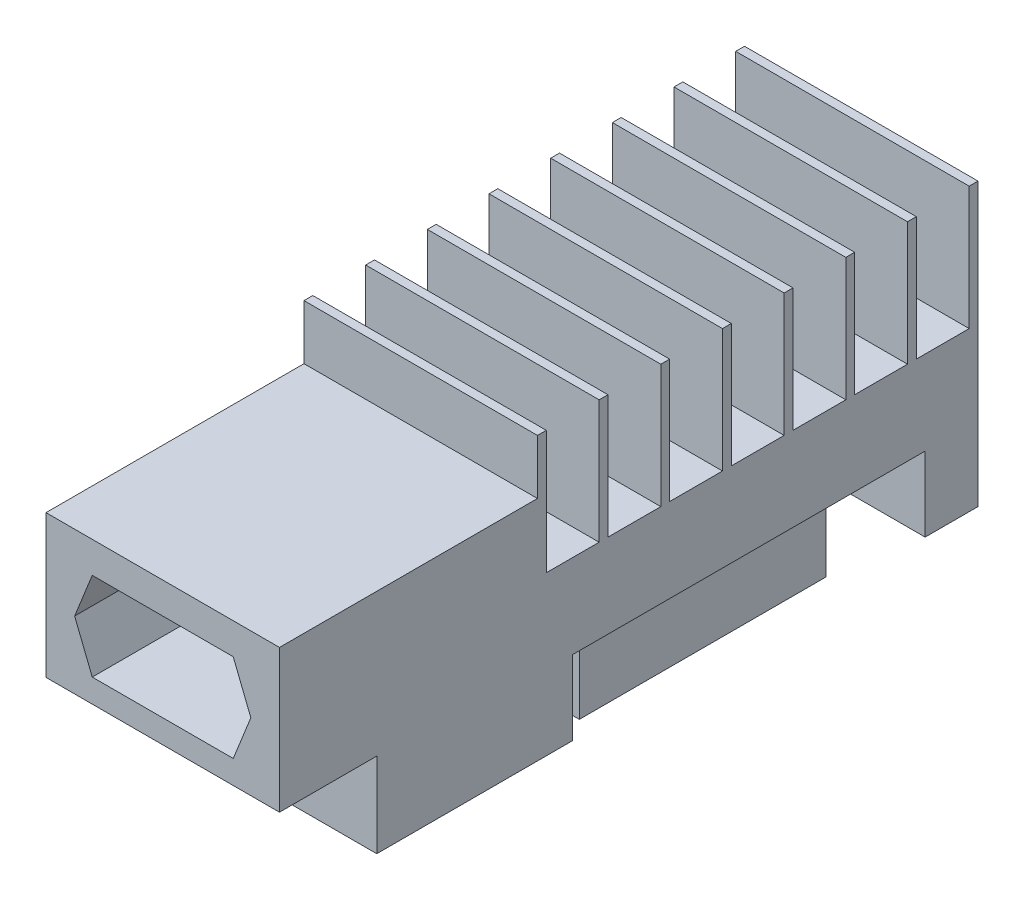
ISO-10303-21;
HEADER;
FILE_DESCRIPTION(('STEP AP214'),'2;1');
FILE_NAME('part.step','',(''),(''),'','','');
FILE_SCHEMA(('AUTOMOTIVE_DESIGN { 1 0 10303 214 1 1 1 1 }'));
ENDSEC;
DATA;
#1=APPLICATION_CONTEXT('core data for automotive mechanical design processes');
#2=APPLICATION_PROTOCOL_DEFINITION('international standard','automotive_design',2000,#1);
#3=PRODUCT_CONTEXT('',#1,'mechanical');
#4=PRODUCT('Part','Part','',(#3));
#5=PRODUCT_RELATED_PRODUCT_CATEGORY('part','',(#4));
#6=PRODUCT_DEFINITION_FORMATION('','',#4);
#7=PRODUCT_DEFINITION_CONTEXT('part definition',#1,'design');
#8=PRODUCT_DEFINITION('design','',#6,#7);
#9=PRODUCT_DEFINITION_SHAPE('','',#8);
#10=(LENGTH_UNIT() NAMED_UNIT(*) SI_UNIT(.MILLI.,.METRE.));
#11=(NAMED_UNIT(*) PLANE_ANGLE_UNIT() SI_UNIT($,.RADIAN.));
#12=(NAMED_UNIT(*) SI_UNIT($,.STERADIAN.) SOLID_ANGLE_UNIT());
#13=UNCERTAINTY_MEASURE_WITH_UNIT(LENGTH_MEASURE(1.E-05),#10,'distance_accuracy_value','');
#14=(GEOMETRIC_REPRESENTATION_CONTEXT(3) GLOBAL_UNCERTAINTY_ASSIGNED_CONTEXT((#13)) GLOBAL_UNIT_ASSIGNED_CONTEXT((#10,
#11,#12)) REPRESENTATION_CONTEXT('',''));
#15=CARTESIAN_POINT('',(0.,0.,0.));
#16=DIRECTION('',(0.,0.,1.));
#17=DIRECTION('',(1.,0.,0.));
#18=AXIS2_PLACEMENT_3D('',#15,#16,#17);
#19=CARTESIAN_POINT('',(6.,0.23,22.));
#20=DIRECTION('',(1.,0.,0.));
#21=DIRECTION('',(0.,0.,-1.));
#22=AXIS2_PLACEMENT_3D('',#19,#20,#21);
#23=PLANE('',#22);
#24=DIRECTION('',(0.,0.,-1.));
#25=VECTOR('',#24,1.);
#26=CARTESIAN_POINT('',(6.,4.23,22.));
#27=LINE('',#26,#25);
#28=CARTESIAN_POINT('',(6.,4.23,22.));
#29=VERTEX_POINT('',#28);
#30=CARTESIAN_POINT('',(6.,4.23,8.));
#31=VERTEX_POINT('',#30);
#32=EDGE_CURVE('E107',#29,#31,#27,.T.);
#33=ORIENTED_EDGE('',*,*,#32,.F.);
#34=DIRECTION('',(0.,1.,0.));
#35=VECTOR('',#34,1.);
#36=CARTESIAN_POINT('',(6.,0.23,22.));
#37=LINE('',#36,#35);
#38=CARTESIAN_POINT('',(6.,0.23,22.));
#39=VERTEX_POINT('',#38);
#40=EDGE_CURVE('E12',#39,#29,#37,.T.);
#41=ORIENTED_EDGE('',*,*,#40,.F.);
#42=DIRECTION('',(0.,0.,-1.));
#43=VECTOR('',#42,1.);
#44=CARTESIAN_POINT('',(6.,0.23,22.));
#45=LINE('',#44,#43);
#46=CARTESIAN_POINT('',(6.,0.23,8.));
#47=VERTEX_POINT('',#46);
#48=EDGE_CURVE('E101',#39,#47,#45,.T.);
#49=ORIENTED_EDGE('',*,*,#48,.T.);
#50=DIRECTION('',(0.,1.,0.));
#51=VECTOR('',#50,1.);
#52=CARTESIAN_POINT('',(6.,0.23,8.));
#53=LINE('',#52,#51);
#54=EDGE_CURVE('E46',#47,#31,#53,.T.);
#55=ORIENTED_EDGE('',*,*,#54,.T.);
#56=EDGE_LOOP('',(#33,#41,#49,#55));
#57=FACE_BOUND('',#56,.T.);
#58=ADVANCED_FACE('F43',(#57),#23,.T.);
#59=CARTESIAN_POINT('',(-6.,0.23,22.));
#60=DIRECTION('',(0.,0.,1.));
#61=DIRECTION('',(1.,0.,0.));
#62=AXIS2_PLACEMENT_3D('',#59,#60,#61);
#63=PLANE('',#62);
#64=DIRECTION('',(1.,0.,0.));
#65=VECTOR('',#64,1.);
#66=CARTESIAN_POINT('',(-6.,4.23,22.));
#67=LINE('',#66,#65);
#68=CARTESIAN_POINT('',(-6.,4.23,22.));
#69=VERTEX_POINT('',#68);
#70=EDGE_CURVE('E103',#69,#29,#67,.T.);
#71=ORIENTED_EDGE('',*,*,#70,.F.);
#72=DIRECTION('',(0.,1.,0.));
#73=VECTOR('',#72,1.);
#74=CARTESIAN_POINT('',(-6.,0.23,22.));
#75=LINE('',#74,#73);
#76=CARTESIAN_POINT('',(-6.,0.23,22.));
#77=VERTEX_POINT('',#76);
#78=EDGE_CURVE('E52',#77,#69,#75,.T.);
#79=ORIENTED_EDGE('',*,*,#78,.F.);
#80=DIRECTION('',(1.,0.,0.));
#81=VECTOR('',#80,1.);
#82=CARTESIAN_POINT('',(-6.,0.23,22.));
#83=LINE('',#82,#81);
#84=EDGE_CURVE('E98',#77,#39,#83,.T.);
#85=ORIENTED_EDGE('',*,*,#84,.T.);
#86=ORIENTED_EDGE('',*,*,#40,.T.);
#87=EDGE_LOOP('',(#71,#79,#85,#86));
#88=FACE_BOUND('',#87,.T.);
#89=ADVANCED_FACE('F117',(#88),#63,.T.);
#90=CARTESIAN_POINT('',(-6.,0.23,8.));
#91=DIRECTION('',(-1.,0.,0.));
#92=DIRECTION('',(0.,0.,1.));
#93=AXIS2_PLACEMENT_3D('',#90,#91,#92);
#94=PLANE('',#93);
#95=DIRECTION('',(0.,0.,1.));
#96=VECTOR('',#95,1.);
#97=CARTESIAN_POINT('',(-6.,4.23,8.));
#98=LINE('',#97,#96);
#99=CARTESIAN_POINT('',(-6.,4.23,8.));
#100=VERTEX_POINT('',#99);
#101=EDGE_CURVE('E93',#100,#69,#98,.T.);
#102=ORIENTED_EDGE('',*,*,#101,.F.);
#103=DIRECTION('',(0.,1.,0.));
#104=VECTOR('',#103,1.);
#105=CARTESIAN_POINT('',(-6.,0.23,8.));
#106=LINE('',#105,#104);
#107=CARTESIAN_POINT('',(-6.,0.23,8.));
#108=VERTEX_POINT('',#107);
#109=EDGE_CURVE('E88',#108,#100,#106,.T.);
#110=ORIENTED_EDGE('',*,*,#109,.F.);
#111=DIRECTION('',(0.,0.,1.));
#112=VECTOR('',#111,1.);
#113=CARTESIAN_POINT('',(-6.,0.23,8.));
#114=LINE('',#113,#112);
#115=EDGE_CURVE('E91',#108,#77,#114,.T.);
#116=ORIENTED_EDGE('',*,*,#115,.T.);
#117=ORIENTED_EDGE('',*,*,#78,.T.);
#118=EDGE_LOOP('',(#102,#110,#116,#117));
#119=FACE_BOUND('',#118,.T.);
#120=ADVANCED_FACE('F90',(#119),#94,.T.);
#121=CARTESIAN_POINT('',(6.,0.23,8.));
#122=DIRECTION('',(0.,0.,-1.));
#123=DIRECTION('',(-1.,0.,0.));
#124=AXIS2_PLACEMENT_3D('',#121,#122,#123);
#125=PLANE('',#124);
#126=DIRECTION('',(-1.,0.,0.));
#127=VECTOR('',#126,1.);
#128=CARTESIAN_POINT('',(6.,4.23,8.));
#129=LINE('',#128,#127);
#130=EDGE_CURVE('E110',#31,#100,#129,.T.);
#131=ORIENTED_EDGE('',*,*,#130,.F.);
#132=ORIENTED_EDGE('',*,*,#54,.F.);
#133=DIRECTION('',(-1.,0.,0.));
#134=VECTOR('',#133,1.);
#135=CARTESIAN_POINT('',(6.,0.23,8.));
#136=LINE('',#135,#134);
#137=EDGE_CURVE('E97',#47,#108,#136,.T.);
#138=ORIENTED_EDGE('',*,*,#137,.T.);
#139=ORIENTED_EDGE('',*,*,#109,.T.);
#140=EDGE_LOOP('',(#131,#132,#138,#139));
#141=FACE_BOUND('',#140,.T.);
#142=ADVANCED_FACE('F100',(#141),#125,.T.);
#143=CARTESIAN_POINT('',(6.,0.23,22.));
#144=DIRECTION('',(0.,-1.,0.));
#145=DIRECTION('',(0.,0.,-1.));
#146=AXIS2_PLACEMENT_3D('',#143,#144,#145);
#147=PLANE('',#146);
#148=ORIENTED_EDGE('',*,*,#48,.F.);
#149=ORIENTED_EDGE('',*,*,#84,.F.);
#150=ORIENTED_EDGE('',*,*,#115,.F.);
#151=ORIENTED_EDGE('',*,*,#137,.F.);
#152=EDGE_LOOP('',(#148,#149,#150,#151));
#153=FACE_BOUND('',#152,.T.);
#154=ADVANCED_FACE('F96',(#153),#147,.T.);
#155=CARTESIAN_POINT('',(6.,4.23,22.));
#156=DIRECTION('',(0.,-1.,0.));
#157=DIRECTION('',(0.,0.,-1.));
#158=AXIS2_PLACEMENT_3D('',#155,#156,#157);
#159=PLANE('',#158);
#160=ORIENTED_EDGE('',*,*,#32,.T.);
#161=ORIENTED_EDGE('',*,*,#130,.T.);
#162=ORIENTED_EDGE('',*,*,#101,.T.);
#163=ORIENTED_EDGE('',*,*,#70,.T.);
#164=EDGE_LOOP('',(#160,#161,#162,#163));
#165=FACE_BOUND('',#164,.T.);
#166=ADVANCED_FACE('F116',(#165),#159,.F.);
#167=CLOSED_SHELL('',(#58,#89,#120,#142,#154,#166));
#168=MANIFOLD_SOLID_BREP('B2',#167);
#169=CARTESIAN_POINT('',(6.625,0.,0.));
#170=DIRECTION('',(0.,1.,0.));
#171=DIRECTION('',(0.,0.,1.));
#172=AXIS2_PLACEMENT_3D('',#169,#170,#171);
#173=PLANE('',#172);
#174=DIRECTION('',(0.,0.,-1.));
#175=VECTOR('',#174,1.);
#176=CARTESIAN_POINT('',(6.625,0.,39.64));
#177=LINE('',#176,#175);
#178=CARTESIAN_POINT('',(6.625,0.,3.));
#179=VERTEX_POINT('',#178);
#180=CARTESIAN_POINT('',(6.625,0.,0.));
#181=VERTEX_POINT('',#180);
#182=EDGE_CURVE('E768',#179,#181,#177,.T.);
#183=ORIENTED_EDGE('',*,*,#182,.F.);
#184=DIRECTION('',(-1.,0.,0.));
#185=VECTOR('',#184,1.);
#186=CARTESIAN_POINT('',(6.626,0.,3.));
#187=LINE('',#186,#185);
#188=CARTESIAN_POINT('',(-6.625,0.,3.));
#189=VERTEX_POINT('',#188);
#190=EDGE_CURVE('E534',#179,#189,#187,.T.);
#191=ORIENTED_EDGE('',*,*,#190,.T.);
#192=DIRECTION('',(0.,0.,1.));
#193=VECTOR('',#192,1.);
#194=CARTESIAN_POINT('',(-6.625,0.,0.));
#195=LINE('',#194,#193);
#196=CARTESIAN_POINT('',(-6.625,0.,0.));
#197=VERTEX_POINT('',#196);
#198=EDGE_CURVE('E772',#197,#189,#195,.T.);
#199=ORIENTED_EDGE('',*,*,#198,.F.);
#200=DIRECTION('',(-1.,0.,0.));
#201=VECTOR('',#200,1.);
#202=CARTESIAN_POINT('',(6.625,0.,0.));
#203=LINE('',#202,#201);
#204=EDGE_CURVE('E767',#181,#197,#203,.T.);
#205=ORIENTED_EDGE('',*,*,#204,.F.);
#206=EDGE_LOOP('',(#183,#191,#199,#205));
#207=FACE_BOUND('',#206,.T.);
#208=ADVANCED_FACE('F167',(#207),#173,.F.);
#209=CARTESIAN_POINT('',(6.625,16.,0.));
#210=DIRECTION('',(0.,1.,0.));
#211=DIRECTION('',(0.,0.,1.));
#212=AXIS2_PLACEMENT_3D('',#209,#210,#211);
#213=PLANE('',#212);
#214=DIRECTION('',(-1.,0.,0.));
#215=VECTOR('',#214,1.);
#216=CARTESIAN_POINT('',(6.626,16.,25.));
#217=LINE('',#216,#215);
#218=CARTESIAN_POINT('',(6.625,16.,25.));
#219=VERTEX_POINT('',#218);
#220=CARTESIAN_POINT('',(-6.625,16.,25.));
#221=VERTEX_POINT('',#220);
#222=EDGE_CURVE('E571',#219,#221,#217,.T.);
#223=ORIENTED_EDGE('',*,*,#222,.F.);
#224=DIRECTION('',(0.,0.,-1.));
#225=VECTOR('',#224,1.);
#226=CARTESIAN_POINT('',(6.625,16.,39.64));
#227=LINE('',#226,#225);
#228=CARTESIAN_POINT('',(6.625,16.,24.5));
#229=VERTEX_POINT('',#228);
#230=EDGE_CURVE('E775',#219,#229,#227,.T.);
#231=ORIENTED_EDGE('',*,*,#230,.T.);
#232=DIRECTION('',(-1.,0.,0.));
#233=VECTOR('',#232,1.);
#234=CARTESIAN_POINT('',(6.626,16.,24.5));
#235=LINE('',#234,#233);
#236=CARTESIAN_POINT('',(-6.625,16.,24.5));
#237=VERTEX_POINT('',#236);
#238=EDGE_CURVE('E598',#229,#237,#235,.T.);
#239=ORIENTED_EDGE('',*,*,#238,.T.);
#240=DIRECTION('',(0.,0.,1.));
#241=VECTOR('',#240,1.);
#242=CARTESIAN_POINT('',(-6.625,16.,0.));
#243=LINE('',#242,#241);
#244=EDGE_CURVE('E781',#237,#221,#243,.T.);
#245=ORIENTED_EDGE('',*,*,#244,.T.);
#246=EDGE_LOOP('',(#223,#231,#239,#245));
#247=FACE_BOUND('',#246,.T.);
#248=ADVANCED_FACE('F857',(#247),#213,.T.);
#249=DIRECTION('',(-1.,0.,0.));
#250=VECTOR('',#249,1.);
#251=CARTESIAN_POINT('',(6.626,16.,21.5));
#252=LINE('',#251,#250);
#253=CARTESIAN_POINT('',(6.625,16.,21.5));
#254=VERTEX_POINT('',#253);
#255=CARTESIAN_POINT('',(-6.625,16.,21.5));
#256=VERTEX_POINT('',#255);
#257=EDGE_CURVE('E604',#254,#256,#252,.T.);
#258=ORIENTED_EDGE('',*,*,#257,.F.);
#259=CARTESIAN_POINT('',(6.625,16.,21.));
#260=VERTEX_POINT('',#259);
#261=EDGE_CURVE('E778',#254,#260,#227,.T.);
#262=ORIENTED_EDGE('',*,*,#261,.T.);
#263=DIRECTION('',(-1.,0.,0.));
#264=VECTOR('',#263,1.);
#265=CARTESIAN_POINT('',(6.626,16.,21.));
#266=LINE('',#265,#264);
#267=CARTESIAN_POINT('',(-6.625,16.,21.));
#268=VERTEX_POINT('',#267);
#269=EDGE_CURVE('E624',#260,#268,#266,.T.);
#270=ORIENTED_EDGE('',*,*,#269,.T.);
#271=EDGE_CURVE('E849',#268,#256,#243,.T.);
#272=ORIENTED_EDGE('',*,*,#271,.T.);
#273=EDGE_LOOP('',(#258,#262,#270,#272));
#274=FACE_BOUND('',#273,.T.);
#275=ADVANCED_FACE('F829',(#274),#213,.T.);
#276=DIRECTION('',(-1.,0.,0.));
#277=VECTOR('',#276,1.);
#278=CARTESIAN_POINT('',(6.626,16.,18.));
#279=LINE('',#278,#277);
#280=CARTESIAN_POINT('',(6.625,16.,18.));
#281=VERTEX_POINT('',#280);
#282=CARTESIAN_POINT('',(-6.625,16.,18.));
#283=VERTEX_POINT('',#282);
#284=EDGE_CURVE('E630',#281,#283,#279,.T.);
#285=ORIENTED_EDGE('',*,*,#284,.F.);
#286=CARTESIAN_POINT('',(6.625,16.,17.5));
#287=VERTEX_POINT('',#286);
#288=EDGE_CURVE('E816',#281,#287,#227,.T.);
#289=ORIENTED_EDGE('',*,*,#288,.T.);
#290=DIRECTION('',(-1.,0.,0.));
#291=VECTOR('',#290,1.);
#292=CARTESIAN_POINT('',(6.626,16.,17.5));
#293=LINE('',#292,#291);
#294=CARTESIAN_POINT('',(-6.625,16.,17.5));
#295=VERTEX_POINT('',#294);
#296=EDGE_CURVE('E650',#287,#295,#293,.T.);
#297=ORIENTED_EDGE('',*,*,#296,.T.);
#298=EDGE_CURVE('E851',#295,#283,#243,.T.);
#299=ORIENTED_EDGE('',*,*,#298,.T.);
#300=EDGE_LOOP('',(#285,#289,#297,#299));
#301=FACE_BOUND('',#300,.T.);
#302=ADVANCED_FACE('F1179',(#301),#213,.T.);
#303=DIRECTION('',(-1.,0.,0.));
#304=VECTOR('',#303,1.);
#305=CARTESIAN_POINT('',(6.626,16.,14.5));
#306=LINE('',#305,#304);
#307=CARTESIAN_POINT('',(6.625,16.,14.5));
#308=VERTEX_POINT('',#307);
#309=CARTESIAN_POINT('',(-6.625,16.,14.5));
#310=VERTEX_POINT('',#309);
#311=EDGE_CURVE('E656',#308,#310,#306,.T.);
#312=ORIENTED_EDGE('',*,*,#311,.F.);
#313=CARTESIAN_POINT('',(6.625,16.,14.));
#314=VERTEX_POINT('',#313);
#315=EDGE_CURVE('E811',#308,#314,#227,.T.);
#316=ORIENTED_EDGE('',*,*,#315,.T.);
#317=DIRECTION('',(-1.,0.,0.));
#318=VECTOR('',#317,1.);
#319=CARTESIAN_POINT('',(6.626,16.,14.));
#320=LINE('',#319,#318);
#321=CARTESIAN_POINT('',(-6.625,16.,14.));
#322=VERTEX_POINT('',#321);
#323=EDGE_CURVE('E676',#314,#322,#320,.T.);
#324=ORIENTED_EDGE('',*,*,#323,.T.);
#325=EDGE_CURVE('E852',#322,#310,#243,.T.);
#326=ORIENTED_EDGE('',*,*,#325,.T.);
#327=EDGE_LOOP('',(#312,#316,#324,#326));
#328=FACE_BOUND('',#327,.T.);
#329=ADVANCED_FACE('F1172',(#328),#213,.T.);
#330=DIRECTION('',(-1.,0.,0.));
#331=VECTOR('',#330,1.);
#332=CARTESIAN_POINT('',(6.626,16.,11.));
#333=LINE('',#332,#331);
#334=CARTESIAN_POINT('',(6.625,16.,11.));
#335=VERTEX_POINT('',#334);
#336=CARTESIAN_POINT('',(-6.625,16.,11.));
#337=VERTEX_POINT('',#336);
#338=EDGE_CURVE('E682',#335,#337,#333,.T.);
#339=ORIENTED_EDGE('',*,*,#338,.F.);
#340=CARTESIAN_POINT('',(6.625,16.,10.5));
#341=VERTEX_POINT('',#340);
#342=EDGE_CURVE('E806',#335,#341,#227,.T.);
#343=ORIENTED_EDGE('',*,*,#342,.T.);
#344=DIRECTION('',(-1.,0.,0.));
#345=VECTOR('',#344,1.);
#346=CARTESIAN_POINT('',(6.626,16.,10.5));
#347=LINE('',#346,#345);
#348=CARTESIAN_POINT('',(-6.625,16.,10.5));
#349=VERTEX_POINT('',#348);
#350=EDGE_CURVE('E702',#341,#349,#347,.T.);
#351=ORIENTED_EDGE('',*,*,#350,.T.);
#352=EDGE_CURVE('E1413',#349,#337,#243,.T.);
#353=ORIENTED_EDGE('',*,*,#352,.T.);
#354=EDGE_LOOP('',(#339,#343,#351,#353));
#355=FACE_BOUND('',#354,.T.);
#356=ADVANCED_FACE('F1165',(#355),#213,.T.);
#357=DIRECTION('',(-1.,0.,0.));
#358=VECTOR('',#357,1.);
#359=CARTESIAN_POINT('',(6.626,16.,7.5));
#360=LINE('',#359,#358);
#361=CARTESIAN_POINT('',(6.625,16.,7.5));
#362=VERTEX_POINT('',#361);
#363=CARTESIAN_POINT('',(-6.625,16.,7.5));
#364=VERTEX_POINT('',#363);
#365=EDGE_CURVE('E708',#362,#364,#360,.T.);
#366=ORIENTED_EDGE('',*,*,#365,.F.);
#367=CARTESIAN_POINT('',(6.625,16.,7.));
#368=VERTEX_POINT('',#367);
#369=EDGE_CURVE('E801',#362,#368,#227,.T.);
#370=ORIENTED_EDGE('',*,*,#369,.T.);
#371=DIRECTION('',(-1.,0.,0.));
#372=VECTOR('',#371,1.);
#373=CARTESIAN_POINT('',(6.626,16.,7.));
#374=LINE('',#373,#372);
#375=CARTESIAN_POINT('',(-6.625,16.,7.));
#376=VERTEX_POINT('',#375);
#377=EDGE_CURVE('E728',#368,#376,#374,.T.);
#378=ORIENTED_EDGE('',*,*,#377,.T.);
#379=EDGE_CURVE('E1415',#376,#364,#243,.T.);
#380=ORIENTED_EDGE('',*,*,#379,.T.);
#381=EDGE_LOOP('',(#366,#370,#378,#380));
#382=FACE_BOUND('',#381,.T.);
#383=ADVANCED_FACE('F1131',(#382),#213,.T.);
#384=DIRECTION('',(-1.,0.,0.));
#385=VECTOR('',#384,1.);
#386=CARTESIAN_POINT('',(6.626,16.,4.));
#387=LINE('',#386,#385);
#388=CARTESIAN_POINT('',(6.625,16.,4.));
#389=VERTEX_POINT('',#388);
#390=CARTESIAN_POINT('',(-6.625,16.,4.));
#391=VERTEX_POINT('',#390);
#392=EDGE_CURVE('E734',#389,#391,#387,.T.);
#393=ORIENTED_EDGE('',*,*,#392,.F.);
#394=CARTESIAN_POINT('',(6.625,16.,3.5));
#395=VERTEX_POINT('',#394);
#396=EDGE_CURVE('E800',#389,#395,#227,.T.);
#397=ORIENTED_EDGE('',*,*,#396,.T.);
#398=DIRECTION('',(-1.,0.,0.));
#399=VECTOR('',#398,1.);
#400=CARTESIAN_POINT('',(6.626,16.,3.5));
#401=LINE('',#400,#399);
#402=CARTESIAN_POINT('',(-6.625,16.,3.5));
#403=VERTEX_POINT('',#402);
#404=EDGE_CURVE('E754',#395,#403,#401,.T.);
#405=ORIENTED_EDGE('',*,*,#404,.T.);
#406=EDGE_CURVE('E784',#403,#391,#243,.T.);
#407=ORIENTED_EDGE('',*,*,#406,.T.);
#408=EDGE_LOOP('',(#393,#397,#405,#407));
#409=FACE_BOUND('',#408,.T.);
#410=ADVANCED_FACE('F903',(#409),#213,.T.);
#411=CARTESIAN_POINT('',(6.625,0.,39.64));
#412=DIRECTION('',(1.,0.,0.));
#413=DIRECTION('',(0.,0.,-1.));
#414=AXIS2_PLACEMENT_3D('',#411,#412,#413);
#415=PLANE('',#414);
#416=DIRECTION('',(0.,-1.,0.));
#417=VECTOR('',#416,1.);
#418=CARTESIAN_POINT('',(6.625,4.23,3.));
#419=LINE('',#418,#417);
#420=CARTESIAN_POINT('',(6.625,4.23,3.));
#421=VERTEX_POINT('',#420);
#422=EDGE_CURVE('E523',#421,#179,#419,.T.);
#423=ORIENTED_EDGE('',*,*,#422,.T.);
#424=ORIENTED_EDGE('',*,*,#182,.T.);
#425=DIRECTION('',(0.,1.,0.));
#426=VECTOR('',#425,1.);
#427=CARTESIAN_POINT('',(6.625,0.,0.));
#428=LINE('',#427,#426);
#429=CARTESIAN_POINT('',(6.625,16.,0.));
#430=VERTEX_POINT('',#429);
#431=EDGE_CURVE('E171',#181,#430,#428,.T.);
#432=ORIENTED_EDGE('',*,*,#431,.T.);
#433=CARTESIAN_POINT('',(6.625,16.,0.5));
#434=VERTEX_POINT('',#433);
#435=EDGE_CURVE('E757',#434,#430,#227,.T.);
#436=ORIENTED_EDGE('',*,*,#435,.F.);
#437=DIRECTION('',(0.,-1.,0.));
#438=VECTOR('',#437,1.);
#439=CARTESIAN_POINT('',(6.625,16.,0.5));
#440=LINE('',#439,#438);
#441=CARTESIAN_POINT('',(6.625,9.,0.5));
#442=VERTEX_POINT('',#441);
#443=EDGE_CURVE('E731',#434,#442,#440,.T.);
#444=ORIENTED_EDGE('',*,*,#443,.T.);
#445=DIRECTION('',(0.,0.,1.));
#446=VECTOR('',#445,1.);
#447=CARTESIAN_POINT('',(6.625,9.,0.5));
#448=LINE('',#447,#446);
#449=CARTESIAN_POINT('',(6.625,9.,3.5));
#450=VERTEX_POINT('',#449);
#451=EDGE_CURVE('E740',#442,#450,#448,.T.);
#452=ORIENTED_EDGE('',*,*,#451,.T.);
#453=DIRECTION('',(0.,1.,0.));
#454=VECTOR('',#453,1.);
#455=CARTESIAN_POINT('',(6.625,9.,3.5));
#456=LINE('',#455,#454);
#457=EDGE_CURVE('E743',#450,#395,#456,.T.);
#458=ORIENTED_EDGE('',*,*,#457,.T.);
#459=ORIENTED_EDGE('',*,*,#396,.F.);
#460=DIRECTION('',(0.,-1.,0.));
#461=VECTOR('',#460,1.);
#462=CARTESIAN_POINT('',(6.625,16.,4.));
#463=LINE('',#462,#461);
#464=CARTESIAN_POINT('',(6.625,9.,4.));
#465=VERTEX_POINT('',#464);
#466=EDGE_CURVE('E705',#389,#465,#463,.T.);
#467=ORIENTED_EDGE('',*,*,#466,.T.);
#468=DIRECTION('',(0.,0.,1.));
#469=VECTOR('',#468,1.);
#470=CARTESIAN_POINT('',(6.625,9.,4.));
#471=LINE('',#470,#469);
#472=CARTESIAN_POINT('',(6.625,9.,7.));
#473=VERTEX_POINT('',#472);
#474=EDGE_CURVE('E714',#465,#473,#471,.T.);
#475=ORIENTED_EDGE('',*,*,#474,.T.);
#476=DIRECTION('',(0.,1.,0.));
#477=VECTOR('',#476,1.);
#478=CARTESIAN_POINT('',(6.625,9.,7.));
#479=LINE('',#478,#477);
#480=EDGE_CURVE('E717',#473,#368,#479,.T.);
#481=ORIENTED_EDGE('',*,*,#480,.T.);
#482=ORIENTED_EDGE('',*,*,#369,.F.);
#483=DIRECTION('',(0.,-1.,0.));
#484=VECTOR('',#483,1.);
#485=CARTESIAN_POINT('',(6.625,16.,7.5));
#486=LINE('',#485,#484);
#487=CARTESIAN_POINT('',(6.625,9.,7.5));
#488=VERTEX_POINT('',#487);
#489=EDGE_CURVE('E679',#362,#488,#486,.T.);
#490=ORIENTED_EDGE('',*,*,#489,.T.);
#491=DIRECTION('',(0.,0.,1.));
#492=VECTOR('',#491,1.);
#493=CARTESIAN_POINT('',(6.625,9.,7.5));
#494=LINE('',#493,#492);
#495=CARTESIAN_POINT('',(6.625,9.,10.5));
#496=VERTEX_POINT('',#495);
#497=EDGE_CURVE('E688',#488,#496,#494,.T.);
#498=ORIENTED_EDGE('',*,*,#497,.T.);
#499=DIRECTION('',(0.,1.,0.));
#500=VECTOR('',#499,1.);
#501=CARTESIAN_POINT('',(6.625,9.,10.5));
#502=LINE('',#501,#500);
#503=EDGE_CURVE('E691',#496,#341,#502,.T.);
#504=ORIENTED_EDGE('',*,*,#503,.T.);
#505=ORIENTED_EDGE('',*,*,#342,.F.);
#506=DIRECTION('',(0.,-1.,0.));
#507=VECTOR('',#506,1.);
#508=CARTESIAN_POINT('',(6.625,16.,11.));
#509=LINE('',#508,#507);
#510=CARTESIAN_POINT('',(6.625,9.,11.));
#511=VERTEX_POINT('',#510);
#512=EDGE_CURVE('E653',#335,#511,#509,.T.);
#513=ORIENTED_EDGE('',*,*,#512,.T.);
#514=DIRECTION('',(0.,0.,1.));
#515=VECTOR('',#514,1.);
#516=CARTESIAN_POINT('',(6.625,9.,11.));
#517=LINE('',#516,#515);
#518=CARTESIAN_POINT('',(6.625,9.,14.));
#519=VERTEX_POINT('',#518);
#520=EDGE_CURVE('E662',#511,#519,#517,.T.);
#521=ORIENTED_EDGE('',*,*,#520,.T.);
#522=DIRECTION('',(0.,1.,0.));
#523=VECTOR('',#522,1.);
#524=CARTESIAN_POINT('',(6.625,9.,14.));
#525=LINE('',#524,#523);
#526=EDGE_CURVE('E665',#519,#314,#525,.T.);
#527=ORIENTED_EDGE('',*,*,#526,.T.);
#528=ORIENTED_EDGE('',*,*,#315,.F.);
#529=DIRECTION('',(0.,-1.,0.));
#530=VECTOR('',#529,1.);
#531=CARTESIAN_POINT('',(6.625,16.,14.5));
#532=LINE('',#531,#530);
#533=CARTESIAN_POINT('',(6.625,9.,14.5));
#534=VERTEX_POINT('',#533);
#535=EDGE_CURVE('E627',#308,#534,#532,.T.);
#536=ORIENTED_EDGE('',*,*,#535,.T.);
#537=DIRECTION('',(0.,0.,1.));
#538=VECTOR('',#537,1.);
#539=CARTESIAN_POINT('',(6.625,9.,14.5));
#540=LINE('',#539,#538);
#541=CARTESIAN_POINT('',(6.625,9.,17.5));
#542=VERTEX_POINT('',#541);
#543=EDGE_CURVE('E636',#534,#542,#540,.T.);
#544=ORIENTED_EDGE('',*,*,#543,.T.);
#545=DIRECTION('',(0.,1.,0.));
#546=VECTOR('',#545,1.);
#547=CARTESIAN_POINT('',(6.625,9.,17.5));
#548=LINE('',#547,#546);
#549=EDGE_CURVE('E639',#542,#287,#548,.T.);
#550=ORIENTED_EDGE('',*,*,#549,.T.);
#551=ORIENTED_EDGE('',*,*,#288,.F.);
#552=DIRECTION('',(0.,-1.,0.));
#553=VECTOR('',#552,1.);
#554=CARTESIAN_POINT('',(6.625,16.,18.));
#555=LINE('',#554,#553);
#556=CARTESIAN_POINT('',(6.625,9.,18.));
#557=VERTEX_POINT('',#556);
#558=EDGE_CURVE('E601',#281,#557,#555,.T.);
#559=ORIENTED_EDGE('',*,*,#558,.T.);
#560=DIRECTION('',(0.,0.,1.));
#561=VECTOR('',#560,1.);
#562=CARTESIAN_POINT('',(6.625,9.,18.));
#563=LINE('',#562,#561);
#564=CARTESIAN_POINT('',(6.625,9.,21.));
#565=VERTEX_POINT('',#564);
#566=EDGE_CURVE('E610',#557,#565,#563,.T.);
#567=ORIENTED_EDGE('',*,*,#566,.T.);
#568=DIRECTION('',(0.,1.,0.));
#569=VECTOR('',#568,1.);
#570=CARTESIAN_POINT('',(6.625,9.,21.));
#571=LINE('',#570,#569);
#572=EDGE_CURVE('E613',#565,#260,#571,.T.);
#573=ORIENTED_EDGE('',*,*,#572,.T.);
#574=ORIENTED_EDGE('',*,*,#261,.F.);
#575=DIRECTION('',(0.,-1.,0.));
#576=VECTOR('',#575,1.);
#577=CARTESIAN_POINT('',(6.625,16.,21.5));
#578=LINE('',#577,#576);
#579=CARTESIAN_POINT('',(6.625,9.,21.5));
#580=VERTEX_POINT('',#579);
#581=EDGE_CURVE('E581',#254,#580,#578,.T.);
#582=ORIENTED_EDGE('',*,*,#581,.T.);
#583=DIRECTION('',(0.,0.,1.));
#584=VECTOR('',#583,1.);
#585=CARTESIAN_POINT('',(6.625,9.,21.5));
#586=LINE('',#585,#584);
#587=CARTESIAN_POINT('',(6.625,9.,24.5));
#588=VERTEX_POINT('',#587);
#589=EDGE_CURVE('E584',#580,#588,#586,.T.);
#590=ORIENTED_EDGE('',*,*,#589,.T.);
#591=DIRECTION('',(0.,1.,0.));
#592=VECTOR('',#591,1.);
#593=CARTESIAN_POINT('',(6.625,9.,24.5));
#594=LINE('',#593,#592);
#595=EDGE_CURVE('E587',#588,#229,#594,.T.);
#596=ORIENTED_EDGE('',*,*,#595,.T.);
#597=ORIENTED_EDGE('',*,*,#230,.F.);
#598=DIRECTION('',(0.,-1.,0.));
#599=VECTOR('',#598,1.);
#600=CARTESIAN_POINT('',(6.625,16.,25.));
#601=LINE('',#600,#599);
#602=CARTESIAN_POINT('',(6.625,12.9,25.));
#603=VERTEX_POINT('',#602);
#604=EDGE_CURVE('E562',#219,#603,#601,.T.);
#605=ORIENTED_EDGE('',*,*,#604,.T.);
#606=DIRECTION('',(0.,0.,1.));
#607=VECTOR('',#606,1.);
#608=CARTESIAN_POINT('',(6.625,12.9,25.));
#609=LINE('',#608,#607);
#610=CARTESIAN_POINT('',(6.625,12.9,39.64));
#611=VERTEX_POINT('',#610);
#612=EDGE_CURVE('E573',#603,#611,#609,.T.);
#613=ORIENTED_EDGE('',*,*,#612,.T.);
#614=DIRECTION('',(0.,1.,0.));
#615=VECTOR('',#614,1.);
#616=CARTESIAN_POINT('',(6.625,0.,39.64));
#617=LINE('',#616,#615);
#618=CARTESIAN_POINT('',(6.625,4.8,39.64));
#619=VERTEX_POINT('',#618);
#620=EDGE_CURVE('E41',#619,#611,#617,.T.);
#621=ORIENTED_EDGE('',*,*,#620,.F.);
#622=DIRECTION('',(0.,0.,-1.));
#623=VECTOR('',#622,1.);
#624=CARTESIAN_POINT('',(6.625,4.8,39.64));
#625=LINE('',#624,#623);
#626=CARTESIAN_POINT('',(6.625,4.8,34.12));
#627=VERTEX_POINT('',#626);
#628=EDGE_CURVE('E556',#619,#627,#625,.T.);
#629=ORIENTED_EDGE('',*,*,#628,.T.);
#630=DIRECTION('',(0.,-1.,0.));
#631=VECTOR('',#630,1.);
#632=CARTESIAN_POINT('',(6.625,4.8,34.12));
#633=LINE('',#632,#631);
#634=CARTESIAN_POINT('',(6.625,0.,34.12));
#635=VERTEX_POINT('',#634);
#636=EDGE_CURVE('E537',#627,#635,#633,.T.);
#637=ORIENTED_EDGE('',*,*,#636,.T.);
#638=CARTESIAN_POINT('',(6.625,0.,23.));
#639=VERTEX_POINT('',#638);
#640=EDGE_CURVE('E764',#635,#639,#177,.T.);
#641=ORIENTED_EDGE('',*,*,#640,.T.);
#642=DIRECTION('',(0.,1.,0.));
#643=VECTOR('',#642,1.);
#644=CARTESIAN_POINT('',(6.625,0.,23.));
#645=LINE('',#644,#643);
#646=CARTESIAN_POINT('',(6.625,4.23,23.));
#647=VERTEX_POINT('',#646);
#648=EDGE_CURVE('E192',#639,#647,#645,.T.);
#649=ORIENTED_EDGE('',*,*,#648,.T.);
#650=DIRECTION('',(0.,0.,-1.));
#651=VECTOR('',#650,1.);
#652=CARTESIAN_POINT('',(6.625,4.23,23.));
#653=LINE('',#652,#651);
#654=EDGE_CURVE('E520',#647,#421,#653,.T.);
#655=ORIENTED_EDGE('',*,*,#654,.T.);
#656=EDGE_LOOP('',(#423,#424,#432,#436,#444,#452,#458,#459,#467,#475,#481,#482,#490,#498,#504,
#505,#513,#521,#527,#528,#536,#544,#550,#551,#559,#567,#573,#574,#582,#590,#596,#597,#605,#613,
#621,#629,#637,#641,#649,#655));
#657=FACE_BOUND('',#656,.T.);
#658=ADVANCED_FACE('F169',(#657),#415,.T.);
#659=CARTESIAN_POINT('',(-6.625,0.,39.64));
#660=DIRECTION('',(0.,0.,1.));
#661=DIRECTION('',(1.,0.,0.));
#662=AXIS2_PLACEMENT_3D('',#659,#660,#661);
#663=PLANE('',#662);
#664=DIRECTION('',(1.,0.,0.));
#665=VECTOR('',#664,1.);
#666=CARTESIAN_POINT('',(-4.,6.13,39.64));
#667=LINE('',#666,#665);
#668=CARTESIAN_POINT('',(-4.,6.13,39.64));
#669=VERTEX_POINT('',#668);
#670=CARTESIAN_POINT('',(4.,6.13,39.64));
#671=VERTEX_POINT('',#670);
#672=EDGE_CURVE('E184',#669,#671,#667,.T.);
#673=ORIENTED_EDGE('',*,*,#672,.F.);
#674=DIRECTION('',(0.371390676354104,-0.928476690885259,0.));
#675=VECTOR('',#674,1.);
#676=CARTESIAN_POINT('',(-5.,8.63,39.64));
#677=LINE('',#676,#675);
#678=CARTESIAN_POINT('',(-5.,8.63,39.64));
#679=VERTEX_POINT('',#678);
#680=EDGE_CURVE('E483',#679,#669,#677,.T.);
#681=ORIENTED_EDGE('',*,*,#680,.F.);
#682=DIRECTION('',(-0.371390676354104,-0.928476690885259,0.));
#683=VECTOR('',#682,1.);
#684=CARTESIAN_POINT('',(-4.,11.13,39.64));
#685=LINE('',#684,#683);
#686=CARTESIAN_POINT('',(-4.,11.13,39.64));
#687=VERTEX_POINT('',#686);
#688=EDGE_CURVE('E486',#687,#679,#685,.T.);
#689=ORIENTED_EDGE('',*,*,#688,.F.);
#690=DIRECTION('',(-1.,0.,0.));
#691=VECTOR('',#690,1.);
#692=CARTESIAN_POINT('',(4.,11.13,39.64));
#693=LINE('',#692,#691);
#694=CARTESIAN_POINT('',(4.,11.13,39.64));
#695=VERTEX_POINT('',#694);
#696=EDGE_CURVE('E505',#695,#687,#693,.T.);
#697=ORIENTED_EDGE('',*,*,#696,.F.);
#698=DIRECTION('',(-0.371390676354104,0.928476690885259,0.));
#699=VECTOR('',#698,1.);
#700=CARTESIAN_POINT('',(5.,8.63,39.64));
#701=LINE('',#700,#699);
#702=CARTESIAN_POINT('',(5.,8.63,39.64));
#703=VERTEX_POINT('',#702);
#704=EDGE_CURVE('E502',#703,#695,#701,.T.);
#705=ORIENTED_EDGE('',*,*,#704,.F.);
#706=DIRECTION('',(0.371390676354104,0.928476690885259,0.));
#707=VECTOR('',#706,1.);
#708=CARTESIAN_POINT('',(4.,6.13,39.64));
#709=LINE('',#708,#707);
#710=EDGE_CURVE('E500',#671,#703,#709,.T.);
#711=ORIENTED_EDGE('',*,*,#710,.F.);
#712=EDGE_LOOP('',(#673,#681,#689,#697,#705,#711));
#713=FACE_BOUND('',#712,.T.);
#714=DIRECTION('',(-1.,0.,0.));
#715=VECTOR('',#714,1.);
#716=CARTESIAN_POINT('',(6.626,4.8,39.64));
#717=LINE('',#716,#715);
#718=CARTESIAN_POINT('',(-6.625,4.8,39.64));
#719=VERTEX_POINT('',#718);
#720=EDGE_CURVE('E552',#619,#719,#717,.T.);
#721=ORIENTED_EDGE('',*,*,#720,.F.);
#722=ORIENTED_EDGE('',*,*,#620,.T.);
#723=DIRECTION('',(-1.,0.,0.));
#724=VECTOR('',#723,1.);
#725=CARTESIAN_POINT('',(6.626,12.9,39.64));
#726=LINE('',#725,#724);
#727=CARTESIAN_POINT('',(-6.625,12.9,39.64));
#728=VERTEX_POINT('',#727);
#729=EDGE_CURVE('E574',#611,#728,#726,.T.);
#730=ORIENTED_EDGE('',*,*,#729,.T.);
#731=DIRECTION('',(0.,1.,0.));
#732=VECTOR('',#731,1.);
#733=CARTESIAN_POINT('',(-6.625,0.,39.64));
#734=LINE('',#733,#732);
#735=EDGE_CURVE('E176',#719,#728,#734,.T.);
#736=ORIENTED_EDGE('',*,*,#735,.F.);
#737=EDGE_LOOP('',(#721,#722,#730,#736));
#738=FACE_BOUND('',#737,.T.);
#739=ADVANCED_FACE('F918',(#713,#738),#663,.T.);
#740=CARTESIAN_POINT('',(-6.625,0.,0.));
#741=DIRECTION('',(-1.,0.,0.));
#742=DIRECTION('',(0.,0.,1.));
#743=AXIS2_PLACEMENT_3D('',#740,#741,#742);
#744=PLANE('',#743);
#745=DIRECTION('',(0.,-1.,0.));
#746=VECTOR('',#745,1.);
#747=CARTESIAN_POINT('',(-6.625,4.23,3.));
#748=LINE('',#747,#746);
#749=CARTESIAN_POINT('',(-6.625,4.23,3.));
#750=VERTEX_POINT('',#749);
#751=EDGE_CURVE('E526',#750,#189,#748,.T.);
#752=ORIENTED_EDGE('',*,*,#751,.F.);
#753=DIRECTION('',(0.,0.,-1.));
#754=VECTOR('',#753,1.);
#755=CARTESIAN_POINT('',(-6.625,4.23,23.));
#756=LINE('',#755,#754);
#757=CARTESIAN_POINT('',(-6.625,4.23,23.));
#758=VERTEX_POINT('',#757);
#759=EDGE_CURVE('E531',#758,#750,#756,.T.);
#760=ORIENTED_EDGE('',*,*,#759,.F.);
#761=DIRECTION('',(0.,1.,0.));
#762=VECTOR('',#761,1.);
#763=CARTESIAN_POINT('',(-6.625,0.,23.));
#764=LINE('',#763,#762);
#765=CARTESIAN_POINT('',(-6.625,0.,23.));
#766=VERTEX_POINT('',#765);
#767=EDGE_CURVE('E528',#766,#758,#764,.T.);
#768=ORIENTED_EDGE('',*,*,#767,.F.);
#769=CARTESIAN_POINT('',(-6.625,0.,34.12));
#770=VERTEX_POINT('',#769);
#771=EDGE_CURVE('E771',#766,#770,#195,.T.);
#772=ORIENTED_EDGE('',*,*,#771,.T.);
#773=DIRECTION('',(0.,-1.,0.));
#774=VECTOR('',#773,1.);
#775=CARTESIAN_POINT('',(-6.625,4.8,34.12));
#776=LINE('',#775,#774);
#777=CARTESIAN_POINT('',(-6.625,4.8,34.12));
#778=VERTEX_POINT('',#777);
#779=EDGE_CURVE('E549',#778,#770,#776,.T.);
#780=ORIENTED_EDGE('',*,*,#779,.F.);
#781=DIRECTION('',(0.,0.,-1.));
#782=VECTOR('',#781,1.);
#783=CARTESIAN_POINT('',(-6.625,4.8,39.64));
#784=LINE('',#783,#782);
#785=EDGE_CURVE('E546',#719,#778,#784,.T.);
#786=ORIENTED_EDGE('',*,*,#785,.F.);
#787=ORIENTED_EDGE('',*,*,#735,.T.);
#788=DIRECTION('',(0.,0.,1.));
#789=VECTOR('',#788,1.);
#790=CARTESIAN_POINT('',(-6.625,12.9,25.));
#791=LINE('',#790,#789);
#792=CARTESIAN_POINT('',(-6.625,12.9,25.));
#793=VERTEX_POINT('',#792);
#794=EDGE_CURVE('E567',#793,#728,#791,.T.);
#795=ORIENTED_EDGE('',*,*,#794,.F.);
#796=DIRECTION('',(0.,-1.,0.));
#797=VECTOR('',#796,1.);
#798=CARTESIAN_POINT('',(-6.625,16.,25.));
#799=LINE('',#798,#797);
#800=EDGE_CURVE('E565',#221,#793,#799,.T.);
#801=ORIENTED_EDGE('',*,*,#800,.F.);
#802=ORIENTED_EDGE('',*,*,#244,.F.);
#803=DIRECTION('',(0.,1.,0.));
#804=VECTOR('',#803,1.);
#805=CARTESIAN_POINT('',(-6.625,9.,24.5));
#806=LINE('',#805,#804);
#807=CARTESIAN_POINT('',(-6.625,9.,24.5));
#808=VERTEX_POINT('',#807);
#809=EDGE_CURVE('E590',#808,#237,#806,.T.);
#810=ORIENTED_EDGE('',*,*,#809,.F.);
#811=DIRECTION('',(0.,0.,1.));
#812=VECTOR('',#811,1.);
#813=CARTESIAN_POINT('',(-6.625,9.,21.5));
#814=LINE('',#813,#812);
#815=CARTESIAN_POINT('',(-6.625,9.,21.5));
#816=VERTEX_POINT('',#815);
#817=EDGE_CURVE('E595',#816,#808,#814,.T.);
#818=ORIENTED_EDGE('',*,*,#817,.F.);
#819=DIRECTION('',(0.,-1.,0.));
#820=VECTOR('',#819,1.);
#821=CARTESIAN_POINT('',(-6.625,16.,21.5));
#822=LINE('',#821,#820);
#823=EDGE_CURVE('E592',#256,#816,#822,.T.);
#824=ORIENTED_EDGE('',*,*,#823,.F.);
#825=ORIENTED_EDGE('',*,*,#271,.F.);
#826=DIRECTION('',(0.,1.,0.));
#827=VECTOR('',#826,1.);
#828=CARTESIAN_POINT('',(-6.625,9.,21.));
#829=LINE('',#828,#827);
#830=CARTESIAN_POINT('',(-6.625,9.,21.));
#831=VERTEX_POINT('',#830);
#832=EDGE_CURVE('E616',#831,#268,#829,.T.);
#833=ORIENTED_EDGE('',*,*,#832,.F.);
#834=DIRECTION('',(0.,0.,1.));
#835=VECTOR('',#834,1.);
#836=CARTESIAN_POINT('',(-6.625,9.,18.));
#837=LINE('',#836,#835);
#838=CARTESIAN_POINT('',(-6.625,9.,18.));
#839=VERTEX_POINT('',#838);
#840=EDGE_CURVE('E621',#839,#831,#837,.T.);
#841=ORIENTED_EDGE('',*,*,#840,.F.);
#842=DIRECTION('',(0.,-1.,0.));
#843=VECTOR('',#842,1.);
#844=CARTESIAN_POINT('',(-6.625,16.,18.));
#845=LINE('',#844,#843);
#846=EDGE_CURVE('E618',#283,#839,#845,.T.);
#847=ORIENTED_EDGE('',*,*,#846,.F.);
#848=ORIENTED_EDGE('',*,*,#298,.F.);
#849=DIRECTION('',(0.,1.,0.));
#850=VECTOR('',#849,1.);
#851=CARTESIAN_POINT('',(-6.625,9.,17.5));
#852=LINE('',#851,#850);
#853=CARTESIAN_POINT('',(-6.625,9.,17.5));
#854=VERTEX_POINT('',#853);
#855=EDGE_CURVE('E642',#854,#295,#852,.T.);
#856=ORIENTED_EDGE('',*,*,#855,.F.);
#857=DIRECTION('',(0.,0.,1.));
#858=VECTOR('',#857,1.);
#859=CARTESIAN_POINT('',(-6.625,9.,14.5));
#860=LINE('',#859,#858);
#861=CARTESIAN_POINT('',(-6.625,9.,14.5));
#862=VERTEX_POINT('',#861);
#863=EDGE_CURVE('E647',#862,#854,#860,.T.);
#864=ORIENTED_EDGE('',*,*,#863,.F.);
#865=DIRECTION('',(0.,-1.,0.));
#866=VECTOR('',#865,1.);
#867=CARTESIAN_POINT('',(-6.625,16.,14.5));
#868=LINE('',#867,#866);
#869=EDGE_CURVE('E644',#310,#862,#868,.T.);
#870=ORIENTED_EDGE('',*,*,#869,.F.);
#871=ORIENTED_EDGE('',*,*,#325,.F.);
#872=DIRECTION('',(0.,1.,0.));
#873=VECTOR('',#872,1.);
#874=CARTESIAN_POINT('',(-6.625,9.,14.));
#875=LINE('',#874,#873);
#876=CARTESIAN_POINT('',(-6.625,9.,14.));
#877=VERTEX_POINT('',#876);
#878=EDGE_CURVE('E668',#877,#322,#875,.T.);
#879=ORIENTED_EDGE('',*,*,#878,.F.);
#880=DIRECTION('',(0.,0.,1.));
#881=VECTOR('',#880,1.);
#882=CARTESIAN_POINT('',(-6.625,9.,11.));
#883=LINE('',#882,#881);
#884=CARTESIAN_POINT('',(-6.625,9.,11.));
#885=VERTEX_POINT('',#884);
#886=EDGE_CURVE('E673',#885,#877,#883,.T.);
#887=ORIENTED_EDGE('',*,*,#886,.F.);
#888=DIRECTION('',(0.,-1.,0.));
#889=VECTOR('',#888,1.);
#890=CARTESIAN_POINT('',(-6.625,16.,11.));
#891=LINE('',#890,#889);
#892=EDGE_CURVE('E670',#337,#885,#891,.T.);
#893=ORIENTED_EDGE('',*,*,#892,.F.);
#894=ORIENTED_EDGE('',*,*,#352,.F.);
#895=DIRECTION('',(0.,1.,0.));
#896=VECTOR('',#895,1.);
#897=CARTESIAN_POINT('',(-6.625,9.,10.5));
#898=LINE('',#897,#896);
#899=CARTESIAN_POINT('',(-6.625,9.,10.5));
#900=VERTEX_POINT('',#899);
#901=EDGE_CURVE('E694',#900,#349,#898,.T.);
#902=ORIENTED_EDGE('',*,*,#901,.F.);
#903=DIRECTION('',(0.,0.,1.));
#904=VECTOR('',#903,1.);
#905=CARTESIAN_POINT('',(-6.625,9.,7.5));
#906=LINE('',#905,#904);
#907=CARTESIAN_POINT('',(-6.625,9.,7.5));
#908=VERTEX_POINT('',#907);
#909=EDGE_CURVE('E699',#908,#900,#906,.T.);
#910=ORIENTED_EDGE('',*,*,#909,.F.);
#911=DIRECTION('',(0.,-1.,0.));
#912=VECTOR('',#911,1.);
#913=CARTESIAN_POINT('',(-6.625,16.,7.5));
#914=LINE('',#913,#912);
#915=EDGE_CURVE('E696',#364,#908,#914,.T.);
#916=ORIENTED_EDGE('',*,*,#915,.F.);
#917=ORIENTED_EDGE('',*,*,#379,.F.);
#918=DIRECTION('',(0.,1.,0.));
#919=VECTOR('',#918,1.);
#920=CARTESIAN_POINT('',(-6.625,9.,7.));
#921=LINE('',#920,#919);
#922=CARTESIAN_POINT('',(-6.625,9.,7.));
#923=VERTEX_POINT('',#922);
#924=EDGE_CURVE('E720',#923,#376,#921,.T.);
#925=ORIENTED_EDGE('',*,*,#924,.F.);
#926=DIRECTION('',(0.,0.,1.));
#927=VECTOR('',#926,1.);
#928=CARTESIAN_POINT('',(-6.625,9.,4.));
#929=LINE('',#928,#927);
#930=CARTESIAN_POINT('',(-6.625,9.,4.));
#931=VERTEX_POINT('',#930);
#932=EDGE_CURVE('E725',#931,#923,#929,.T.);
#933=ORIENTED_EDGE('',*,*,#932,.F.);
#934=DIRECTION('',(0.,-1.,0.));
#935=VECTOR('',#934,1.);
#936=CARTESIAN_POINT('',(-6.625,16.,4.));
#937=LINE('',#936,#935);
#938=EDGE_CURVE('E722',#391,#931,#937,.T.);
#939=ORIENTED_EDGE('',*,*,#938,.F.);
#940=ORIENTED_EDGE('',*,*,#406,.F.);
#941=DIRECTION('',(0.,1.,0.));
#942=VECTOR('',#941,1.);
#943=CARTESIAN_POINT('',(-6.625,9.,3.5));
#944=LINE('',#943,#942);
#945=CARTESIAN_POINT('',(-6.625,9.,3.5));
#946=VERTEX_POINT('',#945);
#947=EDGE_CURVE('E746',#946,#403,#944,.T.);
#948=ORIENTED_EDGE('',*,*,#947,.F.);
#949=DIRECTION('',(0.,0.,1.));
#950=VECTOR('',#949,1.);
#951=CARTESIAN_POINT('',(-6.625,9.,0.5));
#952=LINE('',#951,#950);
#953=CARTESIAN_POINT('',(-6.625,9.,0.5));
#954=VERTEX_POINT('',#953);
#955=EDGE_CURVE('E751',#954,#946,#952,.T.);
#956=ORIENTED_EDGE('',*,*,#955,.F.);
#957=DIRECTION('',(0.,-1.,0.));
#958=VECTOR('',#957,1.);
#959=CARTESIAN_POINT('',(-6.625,16.,0.5));
#960=LINE('',#959,#958);
#961=CARTESIAN_POINT('',(-6.625,16.,0.5));
#962=VERTEX_POINT('',#961);
#963=EDGE_CURVE('E748',#962,#954,#960,.T.);
#964=ORIENTED_EDGE('',*,*,#963,.F.);
#965=CARTESIAN_POINT('',(-6.625,16.,0.));
#966=VERTEX_POINT('',#965);
#967=EDGE_CURVE('E782',#966,#962,#243,.T.);
#968=ORIENTED_EDGE('',*,*,#967,.F.);
#969=DIRECTION('',(0.,1.,0.));
#970=VECTOR('',#969,1.);
#971=CARTESIAN_POINT('',(-6.625,0.,0.));
#972=LINE('',#971,#970);
#973=EDGE_CURVE('E786',#197,#966,#972,.T.);
#974=ORIENTED_EDGE('',*,*,#973,.F.);
#975=ORIENTED_EDGE('',*,*,#198,.T.);
#976=EDGE_LOOP('',(#752,#760,#768,#772,#780,#786,#787,#795,#801,#802,#810,#818,#824,#825,#833,
#841,#847,#848,#856,#864,#870,#871,#879,#887,#893,#894,#902,#910,#916,#917,#925,#933,#939,#940,
#948,#956,#964,#968,#974,#975));
#977=FACE_BOUND('',#976,.T.);
#978=ADVANCED_FACE('F847',(#977),#744,.T.);
#979=CARTESIAN_POINT('',(6.625,0.,0.));
#980=DIRECTION('',(0.,0.,-1.));
#981=DIRECTION('',(-1.,0.,0.));
#982=AXIS2_PLACEMENT_3D('',#979,#980,#981);
#983=PLANE('',#982);
#984=DIRECTION('',(-1.,0.,0.));
#985=VECTOR('',#984,1.);
#986=CARTESIAN_POINT('',(6.625,16.,0.));
#987=LINE('',#986,#985);
#988=EDGE_CURVE('E777',#430,#966,#987,.T.);
#989=ORIENTED_EDGE('',*,*,#988,.F.);
#990=ORIENTED_EDGE('',*,*,#431,.F.);
#991=ORIENTED_EDGE('',*,*,#204,.T.);
#992=ORIENTED_EDGE('',*,*,#973,.T.);
#993=EDGE_LOOP('',(#989,#990,#991,#992));
#994=FACE_BOUND('',#993,.T.);
#995=ADVANCED_FACE('F796',(#994),#983,.T.);
#996=ORIENTED_EDGE('',*,*,#771,.F.);
#997=DIRECTION('',(-1.,0.,0.));
#998=VECTOR('',#997,1.);
#999=CARTESIAN_POINT('',(6.626,0.,23.));
#1000=LINE('',#999,#998);
#1001=EDGE_CURVE('E540',#639,#766,#1000,.T.);
#1002=ORIENTED_EDGE('',*,*,#1001,.F.);
#1003=ORIENTED_EDGE('',*,*,#640,.F.);
#1004=DIRECTION('',(-1.,0.,0.));
#1005=VECTOR('',#1004,1.);
#1006=CARTESIAN_POINT('',(6.626,0.,34.12));
#1007=LINE('',#1006,#1005);
#1008=EDGE_CURVE('E553',#635,#770,#1007,.T.);
#1009=ORIENTED_EDGE('',*,*,#1008,.T.);
#1010=EDGE_LOOP('',(#996,#1002,#1003,#1009));
#1011=FACE_BOUND('',#1010,.T.);
#1012=ADVANCED_FACE('F890',(#1011),#173,.F.);
#1013=DIRECTION('',(-1.,0.,0.));
#1014=VECTOR('',#1013,1.);
#1015=CARTESIAN_POINT('',(6.626,16.,0.5));
#1016=LINE('',#1015,#1014);
#1017=EDGE_CURVE('E760',#434,#962,#1016,.T.);
#1018=ORIENTED_EDGE('',*,*,#1017,.F.);
#1019=ORIENTED_EDGE('',*,*,#435,.T.);
#1020=ORIENTED_EDGE('',*,*,#988,.T.);
#1021=ORIENTED_EDGE('',*,*,#967,.T.);
#1022=EDGE_LOOP('',(#1018,#1019,#1020,#1021));
#1023=FACE_BOUND('',#1022,.T.);
#1024=ADVANCED_FACE('F799',(#1023),#213,.T.);
#1025=CARTESIAN_POINT('',(6.626,9.,3.5));
#1026=DIRECTION('',(0.,0.,1.));
#1027=DIRECTION('',(0.,-1.,0.));
#1028=AXIS2_PLACEMENT_3D('',#1025,#1026,#1027);
#1029=PLANE('',#1028);
#1030=DIRECTION('',(-1.,0.,0.));
#1031=VECTOR('',#1030,1.);
#1032=CARTESIAN_POINT('',(6.626,9.,3.5));
#1033=LINE('',#1032,#1031);
#1034=EDGE_CURVE('E755',#450,#946,#1033,.T.);
#1035=ORIENTED_EDGE('',*,*,#1034,.T.);
#1036=ORIENTED_EDGE('',*,*,#947,.T.);
#1037=ORIENTED_EDGE('',*,*,#404,.F.);
#1038=ORIENTED_EDGE('',*,*,#457,.F.);
#1039=EDGE_LOOP('',(#1035,#1036,#1037,#1038));
#1040=FACE_BOUND('',#1039,.T.);
#1041=ADVANCED_FACE('F902',(#1040),#1029,.F.);
#1042=CARTESIAN_POINT('',(6.626,9.,0.5));
#1043=DIRECTION('',(0.,-1.,0.));
#1044=DIRECTION('',(0.,0.,-1.));
#1045=AXIS2_PLACEMENT_3D('',#1042,#1043,#1044);
#1046=PLANE('',#1045);
#1047=DIRECTION('',(-1.,0.,0.));
#1048=VECTOR('',#1047,1.);
#1049=CARTESIAN_POINT('',(6.626,9.,0.5));
#1050=LINE('',#1049,#1048);
#1051=EDGE_CURVE('E758',#442,#954,#1050,.T.);
#1052=ORIENTED_EDGE('',*,*,#1051,.T.);
#1053=ORIENTED_EDGE('',*,*,#955,.T.);
#1054=ORIENTED_EDGE('',*,*,#1034,.F.);
#1055=ORIENTED_EDGE('',*,*,#451,.F.);
#1056=EDGE_LOOP('',(#1052,#1053,#1054,#1055));
#1057=FACE_BOUND('',#1056,.T.);
#1058=ADVANCED_FACE('F1139',(#1057),#1046,.F.);
#1059=CARTESIAN_POINT('',(6.626,16.,0.5));
#1060=DIRECTION('',(0.,0.,-1.));
#1061=DIRECTION('',(0.,1.,0.));
#1062=AXIS2_PLACEMENT_3D('',#1059,#1060,#1061);
#1063=PLANE('',#1062);
#1064=ORIENTED_EDGE('',*,*,#1017,.T.);
#1065=ORIENTED_EDGE('',*,*,#963,.T.);
#1066=ORIENTED_EDGE('',*,*,#1051,.F.);
#1067=ORIENTED_EDGE('',*,*,#443,.F.);
#1068=EDGE_LOOP('',(#1064,#1065,#1066,#1067));
#1069=FACE_BOUND('',#1068,.T.);
#1070=ADVANCED_FACE('F1147',(#1069),#1063,.F.);
#1071=CARTESIAN_POINT('',(6.626,9.,7.));
#1072=DIRECTION('',(0.,0.,1.));
#1073=DIRECTION('',(0.,-1.,0.));
#1074=AXIS2_PLACEMENT_3D('',#1071,#1072,#1073);
#1075=PLANE('',#1074);
#1076=DIRECTION('',(-1.,0.,0.));
#1077=VECTOR('',#1076,1.);
#1078=CARTESIAN_POINT('',(6.626,9.,7.));
#1079=LINE('',#1078,#1077);
#1080=EDGE_CURVE('E729',#473,#923,#1079,.T.);
#1081=ORIENTED_EDGE('',*,*,#1080,.T.);
#1082=ORIENTED_EDGE('',*,*,#924,.T.);
#1083=ORIENTED_EDGE('',*,*,#377,.F.);
#1084=ORIENTED_EDGE('',*,*,#480,.F.);
#1085=EDGE_LOOP('',(#1081,#1082,#1083,#1084));
#1086=FACE_BOUND('',#1085,.T.);
#1087=ADVANCED_FACE('F1156',(#1086),#1075,.F.);
#1088=CARTESIAN_POINT('',(6.626,9.,4.));
#1089=DIRECTION('',(0.,-1.,0.));
#1090=DIRECTION('',(0.,0.,-1.));
#1091=AXIS2_PLACEMENT_3D('',#1088,#1089,#1090);
#1092=PLANE('',#1091);
#1093=DIRECTION('',(-1.,0.,0.));
#1094=VECTOR('',#1093,1.);
#1095=CARTESIAN_POINT('',(6.626,9.,4.));
#1096=LINE('',#1095,#1094);
#1097=EDGE_CURVE('E732',#465,#931,#1096,.T.);
#1098=ORIENTED_EDGE('',*,*,#1097,.T.);
#1099=ORIENTED_EDGE('',*,*,#932,.T.);
#1100=ORIENTED_EDGE('',*,*,#1080,.F.);
#1101=ORIENTED_EDGE('',*,*,#474,.F.);
#1102=EDGE_LOOP('',(#1098,#1099,#1100,#1101));
#1103=FACE_BOUND('',#1102,.T.);
#1104=ADVANCED_FACE('F1202',(#1103),#1092,.F.);
#1105=CARTESIAN_POINT('',(6.626,16.,4.));
#1106=DIRECTION('',(0.,0.,-1.));
#1107=DIRECTION('',(0.,1.,0.));
#1108=AXIS2_PLACEMENT_3D('',#1105,#1106,#1107);
#1109=PLANE('',#1108);
#1110=ORIENTED_EDGE('',*,*,#392,.T.);
#1111=ORIENTED_EDGE('',*,*,#938,.T.);
#1112=ORIENTED_EDGE('',*,*,#1097,.F.);
#1113=ORIENTED_EDGE('',*,*,#466,.F.);
#1114=EDGE_LOOP('',(#1110,#1111,#1112,#1113));
#1115=FACE_BOUND('',#1114,.T.);
#1116=ADVANCED_FACE('F1212',(#1115),#1109,.F.);
#1117=CARTESIAN_POINT('',(6.626,9.,10.5));
#1118=DIRECTION('',(0.,0.,1.));
#1119=DIRECTION('',(0.,-1.,0.));
#1120=AXIS2_PLACEMENT_3D('',#1117,#1118,#1119);
#1121=PLANE('',#1120);
#1122=DIRECTION('',(-1.,0.,0.));
#1123=VECTOR('',#1122,1.);
#1124=CARTESIAN_POINT('',(6.626,9.,10.5));
#1125=LINE('',#1124,#1123);
#1126=EDGE_CURVE('E703',#496,#900,#1125,.T.);
#1127=ORIENTED_EDGE('',*,*,#1126,.T.);
#1128=ORIENTED_EDGE('',*,*,#901,.T.);
#1129=ORIENTED_EDGE('',*,*,#350,.F.);
#1130=ORIENTED_EDGE('',*,*,#503,.F.);
#1131=EDGE_LOOP('',(#1127,#1128,#1129,#1130));
#1132=FACE_BOUND('',#1131,.T.);
#1133=ADVANCED_FACE('F1222',(#1132),#1121,.F.);
#1134=CARTESIAN_POINT('',(6.626,9.,7.5));
#1135=DIRECTION('',(0.,-1.,0.));
#1136=DIRECTION('',(0.,0.,-1.));
#1137=AXIS2_PLACEMENT_3D('',#1134,#1135,#1136);
#1138=PLANE('',#1137);
#1139=DIRECTION('',(-1.,0.,0.));
#1140=VECTOR('',#1139,1.);
#1141=CARTESIAN_POINT('',(6.626,9.,7.5));
#1142=LINE('',#1141,#1140);
#1143=EDGE_CURVE('E706',#488,#908,#1142,.T.);
#1144=ORIENTED_EDGE('',*,*,#1143,.T.);
#1145=ORIENTED_EDGE('',*,*,#909,.T.);
#1146=ORIENTED_EDGE('',*,*,#1126,.F.);
#1147=ORIENTED_EDGE('',*,*,#497,.F.);
#1148=EDGE_LOOP('',(#1144,#1145,#1146,#1147));
#1149=FACE_BOUND('',#1148,.T.);
#1150=ADVANCED_FACE('F1232',(#1149),#1138,.F.);
#1151=CARTESIAN_POINT('',(6.626,16.,7.5));
#1152=DIRECTION('',(0.,0.,-1.));
#1153=DIRECTION('',(0.,1.,0.));
#1154=AXIS2_PLACEMENT_3D('',#1151,#1152,#1153);
#1155=PLANE('',#1154);
#1156=ORIENTED_EDGE('',*,*,#365,.T.);
#1157=ORIENTED_EDGE('',*,*,#915,.T.);
#1158=ORIENTED_EDGE('',*,*,#1143,.F.);
#1159=ORIENTED_EDGE('',*,*,#489,.F.);
#1160=EDGE_LOOP('',(#1156,#1157,#1158,#1159));
#1161=FACE_BOUND('',#1160,.T.);
#1162=ADVANCED_FACE('F1242',(#1161),#1155,.F.);
#1163=CARTESIAN_POINT('',(6.626,9.,14.));
#1164=DIRECTION('',(0.,0.,1.));
#1165=DIRECTION('',(0.,-1.,0.));
#1166=AXIS2_PLACEMENT_3D('',#1163,#1164,#1165);
#1167=PLANE('',#1166);
#1168=DIRECTION('',(-1.,0.,0.));
#1169=VECTOR('',#1168,1.);
#1170=CARTESIAN_POINT('',(6.626,9.,14.));
#1171=LINE('',#1170,#1169);
#1172=EDGE_CURVE('E677',#519,#877,#1171,.T.);
#1173=ORIENTED_EDGE('',*,*,#1172,.T.);
#1174=ORIENTED_EDGE('',*,*,#878,.T.);
#1175=ORIENTED_EDGE('',*,*,#323,.F.);
#1176=ORIENTED_EDGE('',*,*,#526,.F.);
#1177=EDGE_LOOP('',(#1173,#1174,#1175,#1176));
#1178=FACE_BOUND('',#1177,.T.);
#1179=ADVANCED_FACE('F1252',(#1178),#1167,.F.);
#1180=CARTESIAN_POINT('',(6.626,9.,11.));
#1181=DIRECTION('',(0.,-1.,0.));
#1182=DIRECTION('',(0.,0.,-1.));
#1183=AXIS2_PLACEMENT_3D('',#1180,#1181,#1182);
#1184=PLANE('',#1183);
#1185=DIRECTION('',(-1.,0.,0.));
#1186=VECTOR('',#1185,1.);
#1187=CARTESIAN_POINT('',(6.626,9.,11.));
#1188=LINE('',#1187,#1186);
#1189=EDGE_CURVE('E680',#511,#885,#1188,.T.);
#1190=ORIENTED_EDGE('',*,*,#1189,.T.);
#1191=ORIENTED_EDGE('',*,*,#886,.T.);
#1192=ORIENTED_EDGE('',*,*,#1172,.F.);
#1193=ORIENTED_EDGE('',*,*,#520,.F.);
#1194=EDGE_LOOP('',(#1190,#1191,#1192,#1193));
#1195=FACE_BOUND('',#1194,.T.);
#1196=ADVANCED_FACE('F1262',(#1195),#1184,.F.);
#1197=CARTESIAN_POINT('',(6.626,16.,11.));
#1198=DIRECTION('',(0.,0.,-1.));
#1199=DIRECTION('',(0.,1.,0.));
#1200=AXIS2_PLACEMENT_3D('',#1197,#1198,#1199);
#1201=PLANE('',#1200);
#1202=ORIENTED_EDGE('',*,*,#338,.T.);
#1203=ORIENTED_EDGE('',*,*,#892,.T.);
#1204=ORIENTED_EDGE('',*,*,#1189,.F.);
#1205=ORIENTED_EDGE('',*,*,#512,.F.);
#1206=EDGE_LOOP('',(#1202,#1203,#1204,#1205));
#1207=FACE_BOUND('',#1206,.T.);
#1208=ADVANCED_FACE('F1272',(#1207),#1201,.F.);
#1209=CARTESIAN_POINT('',(6.626,9.,17.5));
#1210=DIRECTION('',(0.,0.,1.));
#1211=DIRECTION('',(0.,-1.,0.));
#1212=AXIS2_PLACEMENT_3D('',#1209,#1210,#1211);
#1213=PLANE('',#1212);
#1214=DIRECTION('',(-1.,0.,0.));
#1215=VECTOR('',#1214,1.);
#1216=CARTESIAN_POINT('',(6.626,9.,17.5));
#1217=LINE('',#1216,#1215);
#1218=EDGE_CURVE('E651',#542,#854,#1217,.T.);
#1219=ORIENTED_EDGE('',*,*,#1218,.T.);
#1220=ORIENTED_EDGE('',*,*,#855,.T.);
#1221=ORIENTED_EDGE('',*,*,#296,.F.);
#1222=ORIENTED_EDGE('',*,*,#549,.F.);
#1223=EDGE_LOOP('',(#1219,#1220,#1221,#1222));
#1224=FACE_BOUND('',#1223,.T.);
#1225=ADVANCED_FACE('F1282',(#1224),#1213,.F.);
#1226=CARTESIAN_POINT('',(6.626,9.,14.5));
#1227=DIRECTION('',(0.,-1.,0.));
#1228=DIRECTION('',(0.,0.,-1.));
#1229=AXIS2_PLACEMENT_3D('',#1226,#1227,#1228);
#1230=PLANE('',#1229);
#1231=DIRECTION('',(-1.,0.,0.));
#1232=VECTOR('',#1231,1.);
#1233=CARTESIAN_POINT('',(6.626,9.,14.5));
#1234=LINE('',#1233,#1232);
#1235=EDGE_CURVE('E654',#534,#862,#1234,.T.);
#1236=ORIENTED_EDGE('',*,*,#1235,.T.);
#1237=ORIENTED_EDGE('',*,*,#863,.T.);
#1238=ORIENTED_EDGE('',*,*,#1218,.F.);
#1239=ORIENTED_EDGE('',*,*,#543,.F.);
#1240=EDGE_LOOP('',(#1236,#1237,#1238,#1239));
#1241=FACE_BOUND('',#1240,.T.);
#1242=ADVANCED_FACE('F1292',(#1241),#1230,.F.);
#1243=CARTESIAN_POINT('',(6.626,16.,14.5));
#1244=DIRECTION('',(0.,0.,-1.));
#1245=DIRECTION('',(0.,1.,0.));
#1246=AXIS2_PLACEMENT_3D('',#1243,#1244,#1245);
#1247=PLANE('',#1246);
#1248=ORIENTED_EDGE('',*,*,#311,.T.);
#1249=ORIENTED_EDGE('',*,*,#869,.T.);
#1250=ORIENTED_EDGE('',*,*,#1235,.F.);
#1251=ORIENTED_EDGE('',*,*,#535,.F.);
#1252=EDGE_LOOP('',(#1248,#1249,#1250,#1251));
#1253=FACE_BOUND('',#1252,.T.);
#1254=ADVANCED_FACE('F1302',(#1253),#1247,.F.);
#1255=CARTESIAN_POINT('',(6.626,9.,21.));
#1256=DIRECTION('',(0.,0.,1.));
#1257=DIRECTION('',(0.,-1.,0.));
#1258=AXIS2_PLACEMENT_3D('',#1255,#1256,#1257);
#1259=PLANE('',#1258);
#1260=DIRECTION('',(-1.,0.,0.));
#1261=VECTOR('',#1260,1.);
#1262=CARTESIAN_POINT('',(6.626,9.,21.));
#1263=LINE('',#1262,#1261);
#1264=EDGE_CURVE('E625',#565,#831,#1263,.T.);
#1265=ORIENTED_EDGE('',*,*,#1264,.T.);
#1266=ORIENTED_EDGE('',*,*,#832,.T.);
#1267=ORIENTED_EDGE('',*,*,#269,.F.);
#1268=ORIENTED_EDGE('',*,*,#572,.F.);
#1269=EDGE_LOOP('',(#1265,#1266,#1267,#1268));
#1270=FACE_BOUND('',#1269,.T.);
#1271=ADVANCED_FACE('F833',(#1270),#1259,.F.);
#1272=CARTESIAN_POINT('',(6.626,9.,18.));
#1273=DIRECTION('',(0.,-1.,0.));
#1274=DIRECTION('',(0.,0.,-1.));
#1275=AXIS2_PLACEMENT_3D('',#1272,#1273,#1274);
#1276=PLANE('',#1275);
#1277=DIRECTION('',(-1.,0.,0.));
#1278=VECTOR('',#1277,1.);
#1279=CARTESIAN_POINT('',(6.626,9.,18.));
#1280=LINE('',#1279,#1278);
#1281=EDGE_CURVE('E628',#557,#839,#1280,.T.);
#1282=ORIENTED_EDGE('',*,*,#1281,.T.);
#1283=ORIENTED_EDGE('',*,*,#840,.T.);
#1284=ORIENTED_EDGE('',*,*,#1264,.F.);
#1285=ORIENTED_EDGE('',*,*,#566,.F.);
#1286=EDGE_LOOP('',(#1282,#1283,#1284,#1285));
#1287=FACE_BOUND('',#1286,.T.);
#1288=ADVANCED_FACE('F838',(#1287),#1276,.F.);
#1289=CARTESIAN_POINT('',(6.626,16.,18.));
#1290=DIRECTION('',(0.,0.,-1.));
#1291=DIRECTION('',(0.,1.,0.));
#1292=AXIS2_PLACEMENT_3D('',#1289,#1290,#1291);
#1293=PLANE('',#1292);
#1294=ORIENTED_EDGE('',*,*,#284,.T.);
#1295=ORIENTED_EDGE('',*,*,#846,.T.);
#1296=ORIENTED_EDGE('',*,*,#1281,.F.);
#1297=ORIENTED_EDGE('',*,*,#558,.F.);
#1298=EDGE_LOOP('',(#1294,#1295,#1296,#1297));
#1299=FACE_BOUND('',#1298,.T.);
#1300=ADVANCED_FACE('F840',(#1299),#1293,.F.);
#1301=CARTESIAN_POINT('',(6.626,9.,24.5));
#1302=DIRECTION('',(0.,0.,1.));
#1303=DIRECTION('',(0.,-1.,0.));
#1304=AXIS2_PLACEMENT_3D('',#1301,#1302,#1303);
#1305=PLANE('',#1304);
#1306=DIRECTION('',(-1.,0.,0.));
#1307=VECTOR('',#1306,1.);
#1308=CARTESIAN_POINT('',(6.626,9.,24.5));
#1309=LINE('',#1308,#1307);
#1310=EDGE_CURVE('E599',#588,#808,#1309,.T.);
#1311=ORIENTED_EDGE('',*,*,#1310,.T.);
#1312=ORIENTED_EDGE('',*,*,#809,.T.);
#1313=ORIENTED_EDGE('',*,*,#238,.F.);
#1314=ORIENTED_EDGE('',*,*,#595,.F.);
#1315=EDGE_LOOP('',(#1311,#1312,#1313,#1314));
#1316=FACE_BOUND('',#1315,.T.);
#1317=ADVANCED_FACE('F871',(#1316),#1305,.F.);
#1318=CARTESIAN_POINT('',(6.626,9.,21.5));
#1319=DIRECTION('',(0.,-1.,0.));
#1320=DIRECTION('',(0.,0.,-1.));
#1321=AXIS2_PLACEMENT_3D('',#1318,#1319,#1320);
#1322=PLANE('',#1321);
#1323=DIRECTION('',(-1.,0.,0.));
#1324=VECTOR('',#1323,1.);
#1325=CARTESIAN_POINT('',(6.626,9.,21.5));
#1326=LINE('',#1325,#1324);
#1327=EDGE_CURVE('E602',#580,#816,#1326,.T.);
#1328=ORIENTED_EDGE('',*,*,#1327,.T.);
#1329=ORIENTED_EDGE('',*,*,#817,.T.);
#1330=ORIENTED_EDGE('',*,*,#1310,.F.);
#1331=ORIENTED_EDGE('',*,*,#589,.F.);
#1332=EDGE_LOOP('',(#1328,#1329,#1330,#1331));
#1333=FACE_BOUND('',#1332,.T.);
#1334=ADVANCED_FACE('F874',(#1333),#1322,.F.);
#1335=CARTESIAN_POINT('',(6.626,16.,21.5));
#1336=DIRECTION('',(0.,0.,-1.));
#1337=DIRECTION('',(0.,1.,0.));
#1338=AXIS2_PLACEMENT_3D('',#1335,#1336,#1337);
#1339=PLANE('',#1338);
#1340=ORIENTED_EDGE('',*,*,#257,.T.);
#1341=ORIENTED_EDGE('',*,*,#823,.T.);
#1342=ORIENTED_EDGE('',*,*,#1327,.F.);
#1343=ORIENTED_EDGE('',*,*,#581,.F.);
#1344=EDGE_LOOP('',(#1340,#1341,#1342,#1343));
#1345=FACE_BOUND('',#1344,.T.);
#1346=ADVANCED_FACE('F877',(#1345),#1339,.F.);
#1347=CARTESIAN_POINT('',(6.626,16.,25.));
#1348=DIRECTION('',(0.,0.,-1.));
#1349=DIRECTION('',(-1.,0.,0.));
#1350=AXIS2_PLACEMENT_3D('',#1347,#1348,#1349);
#1351=PLANE('',#1350);
#1352=ORIENTED_EDGE('',*,*,#222,.T.);
#1353=ORIENTED_EDGE('',*,*,#800,.T.);
#1354=DIRECTION('',(-1.,0.,0.));
#1355=VECTOR('',#1354,1.);
#1356=CARTESIAN_POINT('',(6.626,12.9,25.));
#1357=LINE('',#1356,#1355);
#1358=EDGE_CURVE('E570',#603,#793,#1357,.T.);
#1359=ORIENTED_EDGE('',*,*,#1358,.F.);
#1360=ORIENTED_EDGE('',*,*,#604,.F.);
#1361=EDGE_LOOP('',(#1352,#1353,#1359,#1360));
#1362=FACE_BOUND('',#1361,.T.);
#1363=ADVANCED_FACE('F865',(#1362),#1351,.F.);
#1364=CARTESIAN_POINT('',(6.626,12.9,25.));
#1365=DIRECTION('',(0.,-1.,0.));
#1366=DIRECTION('',(0.,0.,-1.));
#1367=AXIS2_PLACEMENT_3D('',#1364,#1365,#1366);
#1368=PLANE('',#1367);
#1369=ORIENTED_EDGE('',*,*,#1358,.T.);
#1370=ORIENTED_EDGE('',*,*,#794,.T.);
#1371=ORIENTED_EDGE('',*,*,#729,.F.);
#1372=ORIENTED_EDGE('',*,*,#612,.F.);
#1373=EDGE_LOOP('',(#1369,#1370,#1371,#1372));
#1374=FACE_BOUND('',#1373,.T.);
#1375=ADVANCED_FACE('F867',(#1374),#1368,.F.);
#1376=CARTESIAN_POINT('',(6.626,4.8,34.12));
#1377=DIRECTION('',(0.,0.,-1.));
#1378=DIRECTION('',(-1.,0.,0.));
#1379=AXIS2_PLACEMENT_3D('',#1376,#1377,#1378);
#1380=PLANE('',#1379);
#1381=DIRECTION('',(-1.,0.,0.));
#1382=VECTOR('',#1381,1.);
#1383=CARTESIAN_POINT('',(6.626,4.8,34.12));
#1384=LINE('',#1383,#1382);
#1385=EDGE_CURVE('E557',#627,#778,#1384,.T.);
#1386=ORIENTED_EDGE('',*,*,#1385,.T.);
#1387=ORIENTED_EDGE('',*,*,#779,.T.);
#1388=ORIENTED_EDGE('',*,*,#1008,.F.);
#1389=ORIENTED_EDGE('',*,*,#636,.F.);
#1390=EDGE_LOOP('',(#1386,#1387,#1388,#1389));
#1391=FACE_BOUND('',#1390,.T.);
#1392=ADVANCED_FACE('F911',(#1391),#1380,.F.);
#1393=CARTESIAN_POINT('',(6.626,4.8,39.64));
#1394=DIRECTION('',(0.,1.,0.));
#1395=DIRECTION('',(0.,0.,1.));
#1396=AXIS2_PLACEMENT_3D('',#1393,#1394,#1395);
#1397=PLANE('',#1396);
#1398=ORIENTED_EDGE('',*,*,#720,.T.);
#1399=ORIENTED_EDGE('',*,*,#785,.T.);
#1400=ORIENTED_EDGE('',*,*,#1385,.F.);
#1401=ORIENTED_EDGE('',*,*,#628,.F.);
#1402=EDGE_LOOP('',(#1398,#1399,#1400,#1401));
#1403=FACE_BOUND('',#1402,.T.);
#1404=ADVANCED_FACE('F914',(#1403),#1397,.F.);
#1405=CARTESIAN_POINT('',(6.626,4.23,3.));
#1406=DIRECTION('',(0.,0.,-1.));
#1407=DIRECTION('',(-1.,0.,0.));
#1408=AXIS2_PLACEMENT_3D('',#1405,#1406,#1407);
#1409=PLANE('',#1408);
#1410=DIRECTION('',(-1.,0.,0.));
#1411=VECTOR('',#1410,1.);
#1412=CARTESIAN_POINT('',(6.626,4.23,3.));
#1413=LINE('',#1412,#1411);
#1414=EDGE_CURVE('E535',#421,#750,#1413,.T.);
#1415=ORIENTED_EDGE('',*,*,#1414,.T.);
#1416=ORIENTED_EDGE('',*,*,#751,.T.);
#1417=ORIENTED_EDGE('',*,*,#190,.F.);
#1418=ORIENTED_EDGE('',*,*,#422,.F.);
#1419=EDGE_LOOP('',(#1415,#1416,#1417,#1418));
#1420=FACE_BOUND('',#1419,.T.);
#1421=ADVANCED_FACE('F962',(#1420),#1409,.F.);
#1422=CARTESIAN_POINT('',(6.626,4.23,23.));
#1423=DIRECTION('',(0.,1.,0.));
#1424=DIRECTION('',(0.,0.,1.));
#1425=AXIS2_PLACEMENT_3D('',#1422,#1423,#1424);
#1426=PLANE('',#1425);
#1427=DIRECTION('',(-1.,0.,0.));
#1428=VECTOR('',#1427,1.);
#1429=CARTESIAN_POINT('',(6.626,4.23,23.));
#1430=LINE('',#1429,#1428);
#1431=EDGE_CURVE('E538',#647,#758,#1430,.T.);
#1432=ORIENTED_EDGE('',*,*,#1431,.T.);
#1433=ORIENTED_EDGE('',*,*,#759,.T.);
#1434=ORIENTED_EDGE('',*,*,#1414,.F.);
#1435=ORIENTED_EDGE('',*,*,#654,.F.);
#1436=EDGE_LOOP('',(#1432,#1433,#1434,#1435));
#1437=FACE_BOUND('',#1436,.T.);
#1438=ADVANCED_FACE('F959',(#1437),#1426,.F.);
#1439=CARTESIAN_POINT('',(6.626,0.,23.));
#1440=DIRECTION('',(0.,0.,1.));
#1441=DIRECTION('',(1.,0.,0.));
#1442=AXIS2_PLACEMENT_3D('',#1439,#1440,#1441);
#1443=PLANE('',#1442);
#1444=ORIENTED_EDGE('',*,*,#1001,.T.);
#1445=ORIENTED_EDGE('',*,*,#767,.T.);
#1446=ORIENTED_EDGE('',*,*,#1431,.F.);
#1447=ORIENTED_EDGE('',*,*,#648,.F.);
#1448=EDGE_LOOP('',(#1444,#1445,#1446,#1447));
#1449=FACE_BOUND('',#1448,.T.);
#1450=ADVANCED_FACE('F948',(#1449),#1443,.F.);
#1451=CARTESIAN_POINT('',(-4.,6.13,31.64));
#1452=DIRECTION('',(0.,-1.,0.));
#1453=DIRECTION('',(0.,0.,-1.));
#1454=AXIS2_PLACEMENT_3D('',#1451,#1452,#1453);
#1455=PLANE('',#1454);
#1456=ORIENTED_EDGE('',*,*,#672,.T.);
#1457=DIRECTION('',(0.,0.,1.));
#1458=VECTOR('',#1457,1.);
#1459=CARTESIAN_POINT('',(4.,6.13,31.64));
#1460=LINE('',#1459,#1458);
#1461=CARTESIAN_POINT('',(4.,6.13,31.64));
#1462=VERTEX_POINT('',#1461);
#1463=EDGE_CURVE('E460',#1462,#671,#1460,.T.);
#1464=ORIENTED_EDGE('',*,*,#1463,.F.);
#1465=DIRECTION('',(1.,0.,0.));
#1466=VECTOR('',#1465,1.);
#1467=CARTESIAN_POINT('',(-4.,6.13,31.64));
#1468=LINE('',#1467,#1466);
#1469=CARTESIAN_POINT('',(-4.,6.13,31.64));
#1470=VERTEX_POINT('',#1469);
#1471=EDGE_CURVE('E464',#1470,#1462,#1468,.T.);
#1472=ORIENTED_EDGE('',*,*,#1471,.F.);
#1473=DIRECTION('',(0.,0.,1.));
#1474=VECTOR('',#1473,1.);
#1475=CARTESIAN_POINT('',(-4.,6.13,31.64));
#1476=LINE('',#1475,#1474);
#1477=EDGE_CURVE('E510',#1470,#669,#1476,.T.);
#1478=ORIENTED_EDGE('',*,*,#1477,.T.);
#1479=EDGE_LOOP('',(#1456,#1464,#1472,#1478));
#1480=FACE_BOUND('',#1479,.T.);
#1481=ADVANCED_FACE('F462',(#1480),#1455,.F.);
#1482=CARTESIAN_POINT('',(-5.,8.63,31.64));
#1483=DIRECTION('',(-0.928476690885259,-0.371390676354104,0.));
#1484=DIRECTION('',(0.371390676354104,-0.928476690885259,0.));
#1485=AXIS2_PLACEMENT_3D('',#1482,#1483,#1484);
#1486=PLANE('',#1485);
#1487=ORIENTED_EDGE('',*,*,#680,.T.);
#1488=ORIENTED_EDGE('',*,*,#1477,.F.);
#1489=DIRECTION('',(0.371390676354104,-0.928476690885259,0.));
#1490=VECTOR('',#1489,1.);
#1491=CARTESIAN_POINT('',(-5.,8.63,31.64));
#1492=LINE('',#1491,#1490);
#1493=CARTESIAN_POINT('',(-5.,8.63,31.64));
#1494=VERTEX_POINT('',#1493);
#1495=EDGE_CURVE('E470',#1494,#1470,#1492,.T.);
#1496=ORIENTED_EDGE('',*,*,#1495,.F.);
#1497=DIRECTION('',(0.,0.,1.));
#1498=VECTOR('',#1497,1.);
#1499=CARTESIAN_POINT('',(-5.,8.63,31.64));
#1500=LINE('',#1499,#1498);
#1501=EDGE_CURVE('E512',#1494,#679,#1500,.T.);
#1502=ORIENTED_EDGE('',*,*,#1501,.T.);
#1503=EDGE_LOOP('',(#1487,#1488,#1496,#1502));
#1504=FACE_BOUND('',#1503,.T.);
#1505=ADVANCED_FACE('F940',(#1504),#1486,.F.);
#1506=CARTESIAN_POINT('',(-4.,11.13,31.64));
#1507=DIRECTION('',(-0.928476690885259,0.371390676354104,0.));
#1508=DIRECTION('',(-0.371390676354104,-0.928476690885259,0.));
#1509=AXIS2_PLACEMENT_3D('',#1506,#1507,#1508);
#1510=PLANE('',#1509);
#1511=ORIENTED_EDGE('',*,*,#688,.T.);
#1512=ORIENTED_EDGE('',*,*,#1501,.F.);
#1513=DIRECTION('',(-0.371390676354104,-0.928476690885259,0.));
#1514=VECTOR('',#1513,1.);
#1515=CARTESIAN_POINT('',(-4.,11.13,31.64));
#1516=LINE('',#1515,#1514);
#1517=CARTESIAN_POINT('',(-4.,11.13,31.64));
#1518=VERTEX_POINT('',#1517);
#1519=EDGE_CURVE('E496',#1518,#1494,#1516,.T.);
#1520=ORIENTED_EDGE('',*,*,#1519,.F.);
#1521=DIRECTION('',(0.,0.,1.));
#1522=VECTOR('',#1521,1.);
#1523=CARTESIAN_POINT('',(-4.,11.13,31.64));
#1524=LINE('',#1523,#1522);
#1525=EDGE_CURVE('E514',#1518,#687,#1524,.T.);
#1526=ORIENTED_EDGE('',*,*,#1525,.T.);
#1527=EDGE_LOOP('',(#1511,#1512,#1520,#1526));
#1528=FACE_BOUND('',#1527,.T.);
#1529=ADVANCED_FACE('F938',(#1528),#1510,.F.);
#1530=CARTESIAN_POINT('',(4.,11.13,31.64));
#1531=DIRECTION('',(0.,1.,0.));
#1532=DIRECTION('',(0.,0.,1.));
#1533=AXIS2_PLACEMENT_3D('',#1530,#1531,#1532);
#1534=PLANE('',#1533);
#1535=ORIENTED_EDGE('',*,*,#696,.T.);
#1536=ORIENTED_EDGE('',*,*,#1525,.F.);
#1537=DIRECTION('',(-1.,0.,0.));
#1538=VECTOR('',#1537,1.);
#1539=CARTESIAN_POINT('',(4.,11.13,31.64));
#1540=LINE('',#1539,#1538);
#1541=CARTESIAN_POINT('',(4.,11.13,31.64));
#1542=VERTEX_POINT('',#1541);
#1543=EDGE_CURVE('E493',#1542,#1518,#1540,.T.);
#1544=ORIENTED_EDGE('',*,*,#1543,.F.);
#1545=DIRECTION('',(0.,0.,1.));
#1546=VECTOR('',#1545,1.);
#1547=CARTESIAN_POINT('',(4.,11.13,31.64));
#1548=LINE('',#1547,#1546);
#1549=EDGE_CURVE('E516',#1542,#695,#1548,.T.);
#1550=ORIENTED_EDGE('',*,*,#1549,.T.);
#1551=EDGE_LOOP('',(#1535,#1536,#1544,#1550));
#1552=FACE_BOUND('',#1551,.T.);
#1553=ADVANCED_FACE('F936',(#1552),#1534,.F.);
#1554=CARTESIAN_POINT('',(5.,8.63,31.64));
#1555=DIRECTION('',(0.928476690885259,0.371390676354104,0.));
#1556=DIRECTION('',(-0.371390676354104,0.928476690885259,0.));
#1557=AXIS2_PLACEMENT_3D('',#1554,#1555,#1556);
#1558=PLANE('',#1557);
#1559=ORIENTED_EDGE('',*,*,#704,.T.);
#1560=ORIENTED_EDGE('',*,*,#1549,.F.);
#1561=DIRECTION('',(-0.371390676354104,0.928476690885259,0.));
#1562=VECTOR('',#1561,1.);
#1563=CARTESIAN_POINT('',(5.,8.63,31.64));
#1564=LINE('',#1563,#1562);
#1565=CARTESIAN_POINT('',(5.,8.63,31.64));
#1566=VERTEX_POINT('',#1565);
#1567=EDGE_CURVE('E478',#1566,#1542,#1564,.T.);
#1568=ORIENTED_EDGE('',*,*,#1567,.F.);
#1569=DIRECTION('',(0.,0.,1.));
#1570=VECTOR('',#1569,1.);
#1571=CARTESIAN_POINT('',(5.,8.63,31.64));
#1572=LINE('',#1571,#1570);
#1573=EDGE_CURVE('E469',#1566,#703,#1572,.T.);
#1574=ORIENTED_EDGE('',*,*,#1573,.T.);
#1575=EDGE_LOOP('',(#1559,#1560,#1568,#1574));
#1576=FACE_BOUND('',#1575,.T.);
#1577=ADVANCED_FACE('F932',(#1576),#1558,.F.);
#1578=CARTESIAN_POINT('',(4.,6.13,31.64));
#1579=DIRECTION('',(0.928476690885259,-0.371390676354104,0.));
#1580=DIRECTION('',(0.371390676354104,0.928476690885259,0.));
#1581=AXIS2_PLACEMENT_3D('',#1578,#1579,#1580);
#1582=PLANE('',#1581);
#1583=ORIENTED_EDGE('',*,*,#710,.T.);
#1584=ORIENTED_EDGE('',*,*,#1573,.F.);
#1585=DIRECTION('',(0.371390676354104,0.928476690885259,0.));
#1586=VECTOR('',#1585,1.);
#1587=CARTESIAN_POINT('',(4.,6.13,31.64));
#1588=LINE('',#1587,#1586);
#1589=EDGE_CURVE('E473',#1462,#1566,#1588,.T.);
#1590=ORIENTED_EDGE('',*,*,#1589,.F.);
#1591=ORIENTED_EDGE('',*,*,#1463,.T.);
#1592=EDGE_LOOP('',(#1583,#1584,#1590,#1591));
#1593=FACE_BOUND('',#1592,.T.);
#1594=ADVANCED_FACE('F474',(#1593),#1582,.F.);
#1595=CARTESIAN_POINT('',(4.,6.13,31.64));
#1596=DIRECTION('',(0.,0.,1.));
#1597=DIRECTION('',(1.,0.,0.));
#1598=AXIS2_PLACEMENT_3D('',#1595,#1596,#1597);
#1599=PLANE('',#1598);
#1600=CARTESIAN_POINT('',(-2.3,8.63,31.64));
#1601=DIRECTION('',(0.,0.,1.));
#1602=DIRECTION('',(1.,0.,0.));
#1603=AXIS2_PLACEMENT_3D('',#1600,#1601,#1602);
#1604=CIRCLE('',#1603,0.350000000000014);
#1605=CARTESIAN_POINT('',(-1.94999999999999,8.63,31.64));
#1606=VERTEX_POINT('',#1605);
#1607=EDGE_CURVE('E1089',#1606,#1606,#1604,.T.);
#1608=ORIENTED_EDGE('',*,*,#1607,.F.);
#1609=EDGE_LOOP('',(#1608));
#1610=FACE_BOUND('',#1609,.T.);
#1611=CARTESIAN_POINT('',(2.3,8.63,31.64));
#1612=DIRECTION('',(0.,0.,1.));
#1613=DIRECTION('',(1.,0.,0.));
#1614=AXIS2_PLACEMENT_3D('',#1611,#1612,#1613);
#1615=CIRCLE('',#1614,0.350000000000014);
#1616=CARTESIAN_POINT('',(2.65000000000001,8.63,31.64));
#1617=VERTEX_POINT('',#1616);
#1618=EDGE_CURVE('E1091',#1617,#1617,#1615,.T.);
#1619=ORIENTED_EDGE('',*,*,#1618,.F.);
#1620=EDGE_LOOP('',(#1619));
#1621=FACE_BOUND('',#1620,.T.);
#1622=ORIENTED_EDGE('',*,*,#1471,.T.);
#1623=ORIENTED_EDGE('',*,*,#1589,.T.);
#1624=ORIENTED_EDGE('',*,*,#1567,.T.);
#1625=ORIENTED_EDGE('',*,*,#1543,.T.);
#1626=ORIENTED_EDGE('',*,*,#1519,.T.);
#1627=ORIENTED_EDGE('',*,*,#1495,.T.);
#1628=EDGE_LOOP('',(#1622,#1623,#1624,#1625,#1626,#1627));
#1629=FACE_BOUND('',#1628,.T.);
#1630=ADVANCED_FACE('F480',(#1610,#1621,#1629),#1599,.T.);
#1631=CARTESIAN_POINT('',(2.3,8.63,28.64));
#1632=DIRECTION('',(0.,0.,-1.));
#1633=DIRECTION('',(-1.,0.,0.));
#1634=AXIS2_PLACEMENT_3D('',#1631,#1632,#1633);
#1635=PLANE('',#1634);
#1636=CARTESIAN_POINT('',(2.3,8.63,28.64));
#1637=DIRECTION('',(0.,0.,1.));
#1638=DIRECTION('',(1.,0.,0.));
#1639=AXIS2_PLACEMENT_3D('',#1636,#1637,#1638);
#1640=CIRCLE('',#1639,0.350000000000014);
#1641=CARTESIAN_POINT('',(2.65000000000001,8.63,28.64));
#1642=VERTEX_POINT('',#1641);
#1643=EDGE_CURVE('E489',#1642,#1642,#1640,.T.);
#1644=ORIENTED_EDGE('',*,*,#1643,.T.);
#1645=EDGE_LOOP('',(#1644));
#1646=FACE_BOUND('',#1645,.T.);
#1647=ADVANCED_FACE('F1041',(#1646),#1635,.F.);
#1648=CARTESIAN_POINT('',(2.3,8.63,31.64));
#1649=DIRECTION('',(0.,0.,1.));
#1650=DIRECTION('',(1.,0.,0.));
#1651=AXIS2_PLACEMENT_3D('',#1648,#1649,#1650);
#1652=CYLINDRICAL_SURFACE('',#1651,0.350000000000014);
#1653=ORIENTED_EDGE('',*,*,#1643,.F.);
#1654=EDGE_LOOP('',(#1653));
#1655=FACE_BOUND('',#1654,.T.);
#1656=ORIENTED_EDGE('',*,*,#1618,.T.);
#1657=EDGE_LOOP('',(#1656));
#1658=FACE_BOUND('',#1657,.T.);
#1659=ADVANCED_FACE('F1050',(#1655,#1658),#1652,.F.);
#1660=CARTESIAN_POINT('',(-2.3,8.63,28.64));
#1661=DIRECTION('',(0.,0.,-1.));
#1662=DIRECTION('',(-1.,0.,0.));
#1663=AXIS2_PLACEMENT_3D('',#1660,#1661,#1662);
#1664=PLANE('',#1663);
#1665=CARTESIAN_POINT('',(-2.3,8.63,28.64));
#1666=DIRECTION('',(0.,0.,1.));
#1667=DIRECTION('',(1.,0.,0.));
#1668=AXIS2_PLACEMENT_3D('',#1665,#1666,#1667);
#1669=CIRCLE('',#1668,0.350000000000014);
#1670=CARTESIAN_POINT('',(-1.94999999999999,8.63,28.64));
#1671=VERTEX_POINT('',#1670);
#1672=EDGE_CURVE('E1086',#1671,#1671,#1669,.T.);
#1673=ORIENTED_EDGE('',*,*,#1672,.T.);
#1674=EDGE_LOOP('',(#1673));
#1675=FACE_BOUND('',#1674,.T.);
#1676=ADVANCED_FACE('F1059',(#1675),#1664,.F.);
#1677=CARTESIAN_POINT('',(-2.3,8.63,31.64));
#1678=DIRECTION('',(0.,0.,1.));
#1679=DIRECTION('',(1.,0.,0.));
#1680=AXIS2_PLACEMENT_3D('',#1677,#1678,#1679);
#1681=CYLINDRICAL_SURFACE('',#1680,0.350000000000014);
#1682=ORIENTED_EDGE('',*,*,#1672,.F.);
#1683=EDGE_LOOP('',(#1682));
#1684=FACE_BOUND('',#1683,.T.);
#1685=ORIENTED_EDGE('',*,*,#1607,.T.);
#1686=EDGE_LOOP('',(#1685));
#1687=FACE_BOUND('',#1686,.T.);
#1688=ADVANCED_FACE('F1069',(#1684,#1687),#1681,.F.);
#1689=CLOSED_SHELL('',(#208,#248,#275,#302,#329,#356,#383,#410,#658,#739,#978,#995,#1012,#1024,
#1041,#1058,#1070,#1087,#1104,#1116,#1133,#1150,#1162,#1179,#1196,#1208,#1225,#1242,#1254,#1271,
#1288,#1300,#1317,#1334,#1346,#1363,#1375,#1392,#1404,#1421,#1438,#1450,#1481,#1505,#1529,#1553,
#1577,#1594,#1630,#1647,#1659,#1676,#1688));
#1690=MANIFOLD_SOLID_BREP('B6',#1689);
#1691=ADVANCED_BREP_SHAPE_REPRESENTATION('',(#18,#168,#1690),#14);
#1692=SHAPE_DEFINITION_REPRESENTATION(#9,#1691);
ENDSEC;
END-ISO-10303-21;
